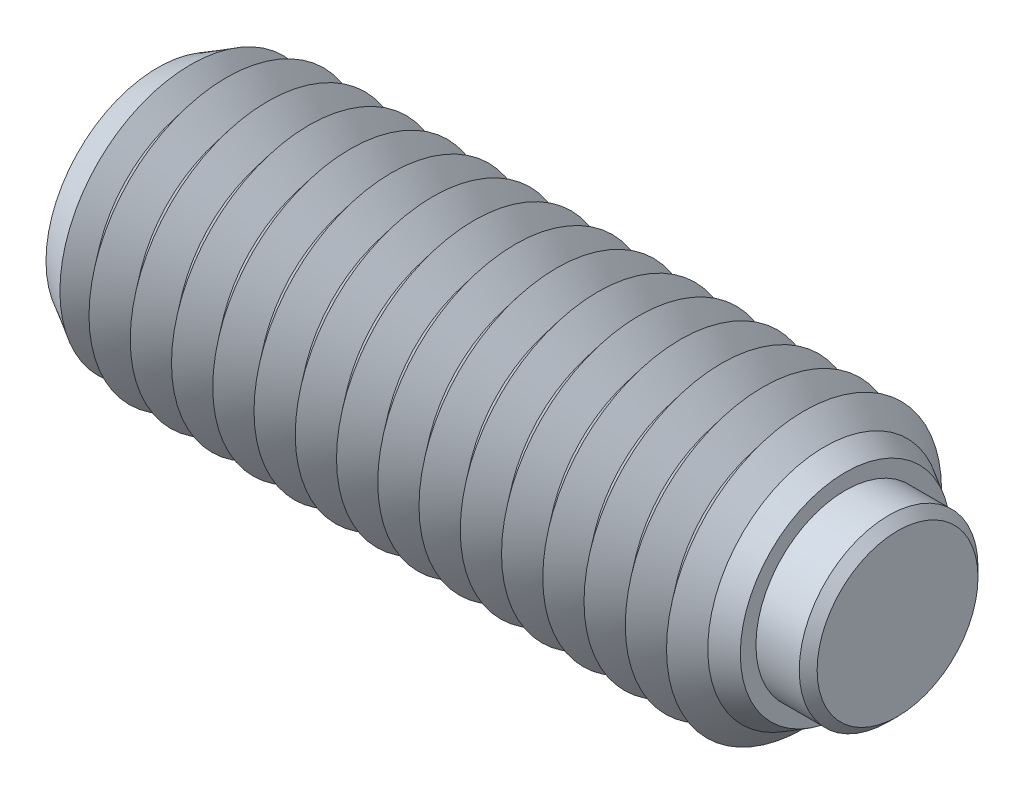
ISO-10303-21;
HEADER;
FILE_DESCRIPTION(('STEP AP214'),'2;1');
FILE_NAME('part.step','',(''),(''),'','','');
FILE_SCHEMA(('AUTOMOTIVE_DESIGN { 1 0 10303 214 1 1 1 1 }'));
ENDSEC;
DATA;
#1=APPLICATION_CONTEXT('core data for automotive mechanical design processes');
#2=APPLICATION_PROTOCOL_DEFINITION('international standard','automotive_design',2000,#1);
#3=PRODUCT_CONTEXT('',#1,'mechanical');
#4=PRODUCT('Part','Part','',(#3));
#5=PRODUCT_RELATED_PRODUCT_CATEGORY('part','',(#4));
#6=PRODUCT_DEFINITION_FORMATION('','',#4);
#7=PRODUCT_DEFINITION_CONTEXT('part definition',#1,'design');
#8=PRODUCT_DEFINITION('design','',#6,#7);
#9=PRODUCT_DEFINITION_SHAPE('','',#8);
#10=(LENGTH_UNIT() NAMED_UNIT(*) SI_UNIT(.MILLI.,.METRE.));
#11=(NAMED_UNIT(*) PLANE_ANGLE_UNIT() SI_UNIT($,.RADIAN.));
#12=(NAMED_UNIT(*) SI_UNIT($,.STERADIAN.) SOLID_ANGLE_UNIT());
#13=UNCERTAINTY_MEASURE_WITH_UNIT(LENGTH_MEASURE(1.E-05),#10,'distance_accuracy_value','');
#14=(GEOMETRIC_REPRESENTATION_CONTEXT(3) GLOBAL_UNCERTAINTY_ASSIGNED_CONTEXT((#13)) GLOBAL_UNIT_ASSIGNED_CONTEXT((#10,
#11,#12)) REPRESENTATION_CONTEXT('',''));
#15=CARTESIAN_POINT('',(0.,0.,0.));
#16=DIRECTION('',(0.,0.,1.));
#17=DIRECTION('',(1.,0.,0.));
#18=AXIS2_PLACEMENT_3D('',#15,#16,#17);
#19=CARTESIAN_POINT('',(2.65,0.,0.));
#20=DIRECTION('',(-1.,0.,0.));
#21=DIRECTION('',(0.,0.,1.));
#22=AXIS2_PLACEMENT_3D('',#19,#20,#21);
#23=CYLINDRICAL_SURFACE('',#22,3.25);
#24=CARTESIAN_POINT('',(2.325,0.,0.));
#25=DIRECTION('',(1.,0.,0.));
#26=DIRECTION('',(0.,0.,-1.));
#27=AXIS2_PLACEMENT_3D('',#24,#25,#26);
#28=CIRCLE('',#27,3.25);
#29=CARTESIAN_POINT('',(2.325,0.,3.25));
#30=VERTEX_POINT('',#29);
#31=EDGE_CURVE('P0_E10',#30,#30,#28,.F.);
#32=CARTESIAN_POINT('',(-1.15,0.,0.));
#33=DIRECTION('',(1.,0.,0.));
#34=DIRECTION('',(0.,0.,-1.));
#35=AXIS2_PLACEMENT_3D('',#32,#33,#34);
#36=CIRCLE('',#35,3.25);
#37=CARTESIAN_POINT('',(-1.15,0.,3.25));
#38=VERTEX_POINT('',#37);
#39=EDGE_CURVE('P0_E25',#38,#38,#36,.T.);
#40=CARTESIAN_POINT('',(2.325,0.,3.25));
#41=CARTESIAN_POINT('',(2.28880208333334,0.,3.25));
#42=CARTESIAN_POINT('',(2.25260416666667,0.,3.25));
#43=CARTESIAN_POINT('',(2.18020833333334,0.,3.25));
#44=CARTESIAN_POINT('',(2.14401041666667,0.,3.25));
#45=CARTESIAN_POINT('',(2.07161458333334,0.,3.25));
#46=CARTESIAN_POINT('',(2.03541666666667,0.,3.25));
#47=CARTESIAN_POINT('',(1.96302083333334,0.,3.25));
#48=CARTESIAN_POINT('',(1.92682291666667,0.,3.25));
#49=CARTESIAN_POINT('',(1.85442708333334,0.,3.25));
#50=CARTESIAN_POINT('',(1.81822916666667,0.,3.25));
#51=CARTESIAN_POINT('',(1.74583333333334,0.,3.25));
#52=CARTESIAN_POINT('',(1.70963541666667,0.,3.25));
#53=CARTESIAN_POINT('',(1.63723958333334,0.,3.25));
#54=CARTESIAN_POINT('',(1.60104166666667,0.,3.25));
#55=CARTESIAN_POINT('',(1.52864583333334,0.,3.25));
#56=CARTESIAN_POINT('',(1.49244791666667,0.,3.25));
#57=CARTESIAN_POINT('',(1.42005208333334,0.,3.25));
#58=CARTESIAN_POINT('',(1.38385416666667,0.,3.25));
#59=CARTESIAN_POINT('',(1.31145833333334,0.,3.25));
#60=CARTESIAN_POINT('',(1.27526041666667,0.,3.25));
#61=CARTESIAN_POINT('',(1.20286458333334,0.,3.25));
#62=CARTESIAN_POINT('',(1.16666666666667,0.,3.25));
#63=CARTESIAN_POINT('',(1.09427083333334,0.,3.25));
#64=CARTESIAN_POINT('',(1.05807291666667,0.,3.25));
#65=CARTESIAN_POINT('',(0.985677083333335,0.,3.25));
#66=CARTESIAN_POINT('',(0.949479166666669,0.,3.25));
#67=CARTESIAN_POINT('',(0.877083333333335,0.,3.25));
#68=CARTESIAN_POINT('',(0.840885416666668,0.,3.25));
#69=CARTESIAN_POINT('',(0.768489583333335,0.,3.25));
#70=CARTESIAN_POINT('',(0.732291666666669,0.,3.25));
#71=CARTESIAN_POINT('',(0.659895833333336,0.,3.25));
#72=CARTESIAN_POINT('',(0.623697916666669,0.,3.25));
#73=CARTESIAN_POINT('',(0.551302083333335,0.,3.25));
#74=CARTESIAN_POINT('',(0.515104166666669,0.,3.25));
#75=CARTESIAN_POINT('',(0.442708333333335,0.,3.25));
#76=CARTESIAN_POINT('',(0.406510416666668,0.,3.25));
#77=CARTESIAN_POINT('',(0.334114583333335,0.,3.25));
#78=CARTESIAN_POINT('',(0.297916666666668,0.,3.25));
#79=CARTESIAN_POINT('',(0.225520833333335,0.,3.25));
#80=CARTESIAN_POINT('',(0.189322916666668,0.,3.25));
#81=CARTESIAN_POINT('',(0.116927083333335,0.,3.25));
#82=CARTESIAN_POINT('',(0.0807291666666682,0.,3.25));
#83=CARTESIAN_POINT('',(0.00833333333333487,0.,3.25));
#84=CARTESIAN_POINT('',(-0.0278645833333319,0.,3.25));
#85=CARTESIAN_POINT('',(-0.100260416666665,0.,3.25));
#86=CARTESIAN_POINT('',(-0.136458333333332,0.,3.25));
#87=CARTESIAN_POINT('',(-0.208854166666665,0.,3.25));
#88=CARTESIAN_POINT('',(-0.245052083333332,0.,3.25));
#89=CARTESIAN_POINT('',(-0.317447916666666,0.,3.25));
#90=CARTESIAN_POINT('',(-0.353645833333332,0.,3.25));
#91=CARTESIAN_POINT('',(-0.426041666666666,0.,3.25));
#92=CARTESIAN_POINT('',(-0.462239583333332,0.,3.25));
#93=CARTESIAN_POINT('',(-0.534635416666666,0.,3.25));
#94=CARTESIAN_POINT('',(-0.570833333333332,0.,3.25));
#95=CARTESIAN_POINT('',(-0.643229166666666,0.,3.25));
#96=CARTESIAN_POINT('',(-0.679427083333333,0.,3.25));
#97=CARTESIAN_POINT('',(-0.751822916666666,0.,3.25));
#98=CARTESIAN_POINT('',(-0.788020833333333,0.,3.25));
#99=CARTESIAN_POINT('',(-0.860416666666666,0.,3.25));
#100=CARTESIAN_POINT('',(-0.896614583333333,0.,3.25));
#101=CARTESIAN_POINT('',(-0.969010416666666,0.,3.25));
#102=CARTESIAN_POINT('',(-1.00520833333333,0.,3.25));
#103=CARTESIAN_POINT('',(-1.07760416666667,0.,3.25));
#104=CARTESIAN_POINT('',(-1.11380208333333,0.,3.25));
#105=CARTESIAN_POINT('',(-1.15,0.,3.25));
#106=B_SPLINE_CURVE_WITH_KNOTS('',3,(#40,#41,#42,#43,#44,#45,#46,#47,#48,#49,#50,#51,#52,#53,
#54,#55,#56,#57,#58,#59,#60,#61,#62,#63,#64,#65,#66,#67,#68,#69,#70,#71,#72,#73,#74,#75,#76,#77,
#78,#79,#80,#81,#82,#83,#84,#85,#86,#87,#88,#89,#90,#91,#92,#93,#94,#95,#96,#97,#98,#99,#100,
#101,#102,#103,#104,#105),.UNSPECIFIED.,.F.,.F.,(4,2,2,2,2,2,2,2,2,2,2,2,2,2,2,2,2,2,2,2,2,2,2,
2,2,2,2,2,2,2,2,2,4),(0.,0.10859375,0.2171875,0.32578125,0.434375,0.54296875,0.6515625,
0.76015625,0.86875,0.977343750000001,1.0859375,1.19453125,1.303125,1.41171875,1.5203125,
1.62890625,1.7375,1.84609375,1.9546875,2.06328125,2.171875,2.28046875,2.3890625,2.49765625,
2.60625,2.71484375,2.8234375,2.93203125,3.040625,3.14921875,3.2578125,3.36640625,3.475),.UNSPECIFIED.);
#107=EDGE_CURVE('P0_BSEAM14',#30,#38,#106,.T.);
#108=ORIENTED_EDGE('',*,*,#31,.T.);
#109=ORIENTED_EDGE('',*,*,#39,.T.);
#110=ORIENTED_EDGE('',*,*,#107,.T.);
#111=ORIENTED_EDGE('',*,*,#107,.F.);
#112=EDGE_LOOP('',(#108,#110,#109,#111));
#113=FACE_BOUND('',#112,.T.);
#114=ADVANCED_FACE('P0_F14',(#113),#23,.T.);
#115=CARTESIAN_POINT('',(2.65,0.,0.));
#116=DIRECTION('',(1.,0.,0.));
#117=DIRECTION('',(0.,0.,-1.));
#118=AXIS2_PLACEMENT_3D('',#115,#116,#117);
#119=PLANE('',#118);
#120=CARTESIAN_POINT('',(2.65,0.,0.));
#121=DIRECTION('',(1.,0.,0.));
#122=DIRECTION('',(0.,0.,-1.));
#123=AXIS2_PLACEMENT_3D('',#120,#121,#122);
#124=CIRCLE('',#123,2.92500000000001);
#125=CARTESIAN_POINT('',(2.65,0.,-2.92500000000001));
#126=VERTEX_POINT('',#125);
#127=EDGE_CURVE('P0_E21',#126,#126,#124,.T.);
#128=ORIENTED_EDGE('',*,*,#127,.T.);
#129=EDGE_LOOP('',(#128));
#130=FACE_BOUND('',#129,.T.);
#131=ADVANCED_FACE('P0_F35',(#130),#119,.T.);
#132=CARTESIAN_POINT('',(-1.15,0.,0.));
#133=DIRECTION('',(1.,0.,0.));
#134=DIRECTION('',(0.,0.,-1.));
#135=AXIS2_PLACEMENT_3D('',#132,#133,#134);
#136=PLANE('',#135);
#137=ORIENTED_EDGE('',*,*,#39,.F.);
#138=EDGE_LOOP('',(#137));
#139=FACE_BOUND('',#138,.T.);
#140=ADVANCED_FACE('P0_F33',(#139),#136,.F.);
#141=CARTESIAN_POINT('',(2.65,0.,0.));
#142=DIRECTION('',(-1.,0.,0.));
#143=DIRECTION('',(0.,0.,1.));
#144=AXIS2_PLACEMENT_3D('',#141,#142,#143);
#145=CONICAL_SURFACE('',#144,2.92500000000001,0.785398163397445);
#146=ORIENTED_EDGE('',*,*,#31,.F.);
#147=EDGE_LOOP('',(#146));
#148=FACE_BOUND('',#147,.T.);
#149=ORIENTED_EDGE('',*,*,#127,.F.);
#150=EDGE_LOOP('',(#149));
#151=FACE_BOUND('',#150,.T.);
#152=ADVANCED_FACE('P0_F16',(#148,#151),#145,.T.);
#153=CLOSED_SHELL('',(#114,#131,#140,#152));
#154=MANIFOLD_SOLID_BREP('P0_B1',#153);
#155=CARTESIAN_POINT('',(-23.25,0.,0.));
#156=DIRECTION('',(-1.,0.,0.));
#157=DIRECTION('',(0.,0.,1.));
#158=AXIS2_PLACEMENT_3D('',#155,#156,#157);
#159=CONICAL_SURFACE('',#158,5.,0.895664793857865);
#160=CARTESIAN_POINT('',(-22.5,0.,0.));
#161=DIRECTION('',(1.,0.,0.));
#162=DIRECTION('',(0.,0.,-1.));
#163=AXIS2_PLACEMENT_3D('',#160,#161,#162);
#164=CIRCLE('',#163,4.06325030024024);
#165=CARTESIAN_POINT('',(-22.5,0.,-4.06325030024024));
#166=VERTEX_POINT('',#165);
#167=EDGE_CURVE('P1_E879',#166,#166,#164,.T.);
#168=ORIENTED_EDGE('',*,*,#167,.F.);
#169=EDGE_LOOP('',(#168));
#170=FACE_BOUND('',#169,.T.);
#171=CARTESIAN_POINT('',(-23.0532143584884,0.,0.));
#172=DIRECTION('',(1.,0.,0.));
#173=DIRECTION('',(0.,0.,-1.));
#174=AXIS2_PLACEMENT_3D('',#171,#172,#173);
#175=CIRCLE('',#174,4.75421481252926);
#176=CARTESIAN_POINT('',(-23.0532143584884,0.,-4.75421481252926));
#177=VERTEX_POINT('',#176);
#178=EDGE_CURVE('P1_E882',#177,#177,#175,.F.);
#179=ORIENTED_EDGE('',*,*,#178,.F.);
#180=EDGE_LOOP('',(#179));
#181=FACE_BOUND('',#180,.T.);
#182=ADVANCED_FACE('P1_F15',(#170,#181),#159,.T.);
#183=CARTESIAN_POINT('',(-1.50000000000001,0.,0.));
#184=DIRECTION('',(1.,0.,0.));
#185=DIRECTION('',(0.,0.,-1.));
#186=AXIS2_PLACEMENT_3D('',#183,#184,#185);
#187=CONICAL_SURFACE('',#186,4.06325030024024,0.895664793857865);
#188=CARTESIAN_POINT('',(-0.750000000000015,0.,0.));
#189=DIRECTION('',(1.,0.,0.));
#190=DIRECTION('',(0.,0.,-1.));
#191=AXIS2_PLACEMENT_3D('',#188,#189,#190);
#192=CIRCLE('',#191,5.);
#193=CARTESIAN_POINT('',(-0.750000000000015,0.,-5.));
#194=VERTEX_POINT('',#193);
#195=EDGE_CURVE('P1_E791',#194,#194,#192,.T.);
#196=ORIENTED_EDGE('',*,*,#195,.F.);
#197=EDGE_LOOP('',(#196));
#198=FACE_BOUND('',#197,.T.);
#199=CARTESIAN_POINT('',(-1.50000000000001,0.,0.));
#200=DIRECTION('',(1.,0.,0.));
#201=DIRECTION('',(0.,0.,-1.));
#202=AXIS2_PLACEMENT_3D('',#199,#200,#201);
#203=CIRCLE('',#202,4.06325030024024);
#204=CARTESIAN_POINT('',(-1.50000000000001,0.,-4.06325030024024));
#205=VERTEX_POINT('',#204);
#206=EDGE_CURVE('P1_E792',#205,#205,#203,.T.);
#207=ORIENTED_EDGE('',*,*,#206,.T.);
#208=EDGE_LOOP('',(#207));
#209=FACE_BOUND('',#208,.T.);
#210=ADVANCED_FACE('P1_F222',(#198,#209),#187,.T.);
#211=CARTESIAN_POINT('',(-2.25000000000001,0.,0.));
#212=DIRECTION('',(-1.,0.,0.));
#213=DIRECTION('',(0.,0.,1.));
#214=AXIS2_PLACEMENT_3D('',#211,#212,#213);
#215=CONICAL_SURFACE('',#214,5.,0.895664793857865);
#216=ORIENTED_EDGE('',*,*,#206,.F.);
#217=EDGE_LOOP('',(#216));
#218=FACE_BOUND('',#217,.T.);
#219=CARTESIAN_POINT('',(-2.25000000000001,0.,0.));
#220=DIRECTION('',(1.,0.,0.));
#221=DIRECTION('',(0.,0.,-1.));
#222=AXIS2_PLACEMENT_3D('',#219,#220,#221);
#223=CIRCLE('',#222,5.);
#224=CARTESIAN_POINT('',(-2.25000000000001,0.,-5.));
#225=VERTEX_POINT('',#224);
#226=EDGE_CURVE('P1_E796',#225,#225,#223,.T.);
#227=ORIENTED_EDGE('',*,*,#226,.T.);
#228=EDGE_LOOP('',(#227));
#229=FACE_BOUND('',#228,.T.);
#230=ADVANCED_FACE('P1_F227',(#218,#229),#215,.T.);
#231=CARTESIAN_POINT('',(-1.15,0.,0.));
#232=DIRECTION('',(1.,0.,0.));
#233=DIRECTION('',(0.,1.,0.));
#234=AXIS2_PLACEMENT_3D('',#231,#232,#233);
#235=PLANE('',#234);
#236=CARTESIAN_POINT('',(-1.15,0.,0.));
#237=DIRECTION('',(1.,0.,0.));
#238=DIRECTION('',(0.,1.,0.));
#239=AXIS2_PLACEMENT_3D('',#236,#237,#238);
#240=CIRCLE('',#239,3.25);
#241=CARTESIAN_POINT('',(-1.15,3.25,0.));
#242=VERTEX_POINT('',#241);
#243=EDGE_CURVE('P1_E414',#242,#242,#240,.T.);
#244=ORIENTED_EDGE('',*,*,#243,.T.);
#245=EDGE_LOOP('',(#244));
#246=FACE_BOUND('',#245,.T.);
#247=ADVANCED_FACE('P1_F341',(#246),#235,.T.);
#248=CARTESIAN_POINT('',(-1.15,0.,0.));
#249=DIRECTION('',(1.,0.,0.));
#250=DIRECTION('',(0.,1.,0.));
#251=AXIS2_PLACEMENT_3D('',#248,#249,#250);
#252=CYLINDRICAL_SURFACE('',#251,3.25);
#253=CARTESIAN_POINT('',(0.75,0.,0.));
#254=DIRECTION('',(1.,0.,0.));
#255=DIRECTION('',(0.,1.,0.));
#256=AXIS2_PLACEMENT_3D('',#253,#254,#255);
#257=CIRCLE('',#256,3.25);
#258=CARTESIAN_POINT('',(0.75,3.25,0.));
#259=VERTEX_POINT('',#258);
#260=EDGE_CURVE('P1_E417',#259,#259,#257,.T.);
#261=CARTESIAN_POINT('',(-1.15,3.25,0.));
#262=CARTESIAN_POINT('',(-1.13020833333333,3.25,0.));
#263=CARTESIAN_POINT('',(-1.11041666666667,3.25,0.));
#264=CARTESIAN_POINT('',(-1.07083333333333,3.25,0.));
#265=CARTESIAN_POINT('',(-1.05104166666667,3.25,0.));
#266=CARTESIAN_POINT('',(-1.01145833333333,3.25,0.));
#267=CARTESIAN_POINT('',(-0.991666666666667,3.25,0.));
#268=CARTESIAN_POINT('',(-0.952083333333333,3.25,0.));
#269=CARTESIAN_POINT('',(-0.932291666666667,3.25,0.));
#270=CARTESIAN_POINT('',(-0.892708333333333,3.25,0.));
#271=CARTESIAN_POINT('',(-0.872916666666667,3.25,0.));
#272=CARTESIAN_POINT('',(-0.833333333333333,3.25,0.));
#273=CARTESIAN_POINT('',(-0.813541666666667,3.25,0.));
#274=CARTESIAN_POINT('',(-0.773958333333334,3.25,0.));
#275=CARTESIAN_POINT('',(-0.754166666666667,3.25,0.));
#276=CARTESIAN_POINT('',(-0.714583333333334,3.25,0.));
#277=CARTESIAN_POINT('',(-0.694791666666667,3.25,0.));
#278=CARTESIAN_POINT('',(-0.655208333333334,3.25,0.));
#279=CARTESIAN_POINT('',(-0.635416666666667,3.25,0.));
#280=CARTESIAN_POINT('',(-0.595833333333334,3.25,0.));
#281=CARTESIAN_POINT('',(-0.576041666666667,3.25,0.));
#282=CARTESIAN_POINT('',(-0.536458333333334,3.25,0.));
#283=CARTESIAN_POINT('',(-0.516666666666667,3.25,0.));
#284=CARTESIAN_POINT('',(-0.477083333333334,3.25,0.));
#285=CARTESIAN_POINT('',(-0.457291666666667,3.25,0.));
#286=CARTESIAN_POINT('',(-0.417708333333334,3.25,0.));
#287=CARTESIAN_POINT('',(-0.397916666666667,3.25,0.));
#288=CARTESIAN_POINT('',(-0.358333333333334,3.25,0.));
#289=CARTESIAN_POINT('',(-0.338541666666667,3.25,0.));
#290=CARTESIAN_POINT('',(-0.298958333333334,3.25,0.));
#291=CARTESIAN_POINT('',(-0.279166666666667,3.25,0.));
#292=CARTESIAN_POINT('',(-0.239583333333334,3.25,0.));
#293=CARTESIAN_POINT('',(-0.219791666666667,3.25,0.));
#294=CARTESIAN_POINT('',(-0.180208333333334,3.25,0.));
#295=CARTESIAN_POINT('',(-0.160416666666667,3.25,0.));
#296=CARTESIAN_POINT('',(-0.120833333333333,3.25,0.));
#297=CARTESIAN_POINT('',(-0.101041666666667,3.25,0.));
#298=CARTESIAN_POINT('',(-0.0614583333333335,3.25,0.));
#299=CARTESIAN_POINT('',(-0.0416666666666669,3.25,0.));
#300=CARTESIAN_POINT('',(-0.00208333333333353,3.25,0.));
#301=CARTESIAN_POINT('',(0.0177083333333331,3.25,0.));
#302=CARTESIAN_POINT('',(0.0572916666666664,3.25,0.));
#303=CARTESIAN_POINT('',(0.0770833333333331,3.25,0.));
#304=CARTESIAN_POINT('',(0.116666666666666,3.25,0.));
#305=CARTESIAN_POINT('',(0.136458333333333,3.25,0.));
#306=CARTESIAN_POINT('',(0.176041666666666,3.25,0.));
#307=CARTESIAN_POINT('',(0.195833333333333,3.25,0.));
#308=CARTESIAN_POINT('',(0.235416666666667,3.25,0.));
#309=CARTESIAN_POINT('',(0.255208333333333,3.25,0.));
#310=CARTESIAN_POINT('',(0.294791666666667,3.25,0.));
#311=CARTESIAN_POINT('',(0.314583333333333,3.25,0.));
#312=CARTESIAN_POINT('',(0.354166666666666,3.25,0.));
#313=CARTESIAN_POINT('',(0.373958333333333,3.25,0.));
#314=CARTESIAN_POINT('',(0.413541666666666,3.25,0.));
#315=CARTESIAN_POINT('',(0.433333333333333,3.25,0.));
#316=CARTESIAN_POINT('',(0.472916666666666,3.25,0.));
#317=CARTESIAN_POINT('',(0.492708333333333,3.25,0.));
#318=CARTESIAN_POINT('',(0.532291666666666,3.25,0.));
#319=CARTESIAN_POINT('',(0.552083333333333,3.25,0.));
#320=CARTESIAN_POINT('',(0.591666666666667,3.25,0.));
#321=CARTESIAN_POINT('',(0.611458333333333,3.25,0.));
#322=CARTESIAN_POINT('',(0.651041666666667,3.25,0.));
#323=CARTESIAN_POINT('',(0.670833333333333,3.25,0.));
#324=CARTESIAN_POINT('',(0.710416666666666,3.25,0.));
#325=CARTESIAN_POINT('',(0.730208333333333,3.25,0.));
#326=CARTESIAN_POINT('',(0.75,3.25,0.));
#327=B_SPLINE_CURVE_WITH_KNOTS('',3,(#261,#262,#263,#264,#265,#266,#267,#268,#269,#270,#271,
#272,#273,#274,#275,#276,#277,#278,#279,#280,#281,#282,#283,#284,#285,#286,#287,#288,#289,#290,
#291,#292,#293,#294,#295,#296,#297,#298,#299,#300,#301,#302,#303,#304,#305,#306,#307,#308,#309,
#310,#311,#312,#313,#314,#315,#316,#317,#318,#319,#320,#321,#322,#323,#324,#325,#326),
.UNSPECIFIED.,.F.,.F.,(4,2,2,2,2,2,2,2,2,2,2,2,2,2,2,2,2,2,2,2,2,2,2,2,2,2,2,2,2,2,2,2,4),(0.,
0.059375,0.11875,0.178125,0.2375,0.296875,0.35625,0.415625,0.475,0.534375,0.59375,0.653125,
0.7125,0.771875,0.83125,0.890625,0.95,1.009375,1.06875,1.128125,1.1875,1.246875,1.30625,
1.365625,1.425,1.484375,1.54375,1.603125,1.6625,1.721875,1.78125,1.840625,1.9),.UNSPECIFIED.);
#328=EDGE_CURVE('P1_BSEAM209',#242,#259,#327,.T.);
#329=ORIENTED_EDGE('',*,*,#243,.F.);
#330=ORIENTED_EDGE('',*,*,#260,.T.);
#331=ORIENTED_EDGE('',*,*,#328,.T.);
#332=ORIENTED_EDGE('',*,*,#328,.F.);
#333=EDGE_LOOP('',(#329,#331,#330,#332));
#334=FACE_BOUND('',#333,.T.);
#335=ADVANCED_FACE('P1_F209',(#334),#252,.F.);
#336=CARTESIAN_POINT('',(0.75,3.81698729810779,0.));
#337=DIRECTION('',(1.,0.,0.));
#338=DIRECTION('',(0.,1.,0.));
#339=AXIS2_PLACEMENT_3D('',#336,#337,#338);
#340=PLANE('',#339);
#341=ORIENTED_EDGE('',*,*,#260,.F.);
#342=EDGE_LOOP('',(#341));
#343=FACE_BOUND('',#342,.T.);
#344=CARTESIAN_POINT('',(0.75,0.,0.));
#345=DIRECTION('',(1.,0.,0.));
#346=DIRECTION('',(0.,1.,0.));
#347=AXIS2_PLACEMENT_3D('',#344,#345,#346);
#348=CIRCLE('',#347,3.81698729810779);
#349=CARTESIAN_POINT('',(0.75,3.81698729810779,0.));
#350=VERTEX_POINT('',#349);
#351=EDGE_CURVE('P1_E121',#350,#350,#348,.T.);
#352=ORIENTED_EDGE('',*,*,#351,.T.);
#353=EDGE_LOOP('',(#352));
#354=FACE_BOUND('',#353,.T.);
#355=ADVANCED_FACE('P1_F206',(#343,#354),#340,.T.);
#356=CARTESIAN_POINT('',(0.75,0.,0.));
#357=DIRECTION('',(-1.,0.,0.));
#358=DIRECTION('',(0.,-1.,0.));
#359=AXIS2_PLACEMENT_3D('',#356,#357,#358);
#360=CONICAL_SURFACE('',#359,3.81698729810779,0.523598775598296);
#361=CARTESIAN_POINT('',(0.,0.,0.));
#362=DIRECTION('',(1.,0.,0.));
#363=DIRECTION('',(0.,0.,-1.));
#364=AXIS2_PLACEMENT_3D('',#361,#362,#363);
#365=CIRCLE('',#364,4.25);
#366=CARTESIAN_POINT('',(0.,0.,-4.25));
#367=VERTEX_POINT('',#366);
#368=EDGE_CURVE('P1_E405',#367,#367,#365,.T.);
#369=ORIENTED_EDGE('',*,*,#368,.T.);
#370=EDGE_LOOP('',(#369));
#371=FACE_BOUND('',#370,.T.);
#372=ORIENTED_EDGE('',*,*,#351,.F.);
#373=EDGE_LOOP('',(#372));
#374=FACE_BOUND('',#373,.T.);
#375=ADVANCED_FACE('P1_F203',(#371,#374),#360,.T.);
#376=CARTESIAN_POINT('',(0.,0.,0.));
#377=DIRECTION('',(-1.,0.,0.));
#378=DIRECTION('',(0.,0.,1.));
#379=AXIS2_PLACEMENT_3D('',#376,#377,#378);
#380=CONICAL_SURFACE('',#379,4.25,0.785398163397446);
#381=ORIENTED_EDGE('',*,*,#195,.T.);
#382=EDGE_LOOP('',(#381));
#383=FACE_BOUND('',#382,.T.);
#384=ORIENTED_EDGE('',*,*,#368,.F.);
#385=EDGE_LOOP('',(#384));
#386=FACE_BOUND('',#385,.T.);
#387=ADVANCED_FACE('P1_F17',(#383,#386),#380,.T.);
#388=CARTESIAN_POINT('',(-3.00000000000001,0.,0.));
#389=DIRECTION('',(1.,0.,0.));
#390=DIRECTION('',(0.,0.,-1.));
#391=AXIS2_PLACEMENT_3D('',#388,#389,#390);
#392=CONICAL_SURFACE('',#391,4.06325030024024,0.895664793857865);
#393=ORIENTED_EDGE('',*,*,#226,.F.);
#394=EDGE_LOOP('',(#393));
#395=FACE_BOUND('',#394,.T.);
#396=CARTESIAN_POINT('',(-3.00000000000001,0.,0.));
#397=DIRECTION('',(1.,0.,0.));
#398=DIRECTION('',(0.,0.,-1.));
#399=AXIS2_PLACEMENT_3D('',#396,#397,#398);
#400=CIRCLE('',#399,4.06325030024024);
#401=CARTESIAN_POINT('',(-3.00000000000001,0.,-4.06325030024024));
#402=VERTEX_POINT('',#401);
#403=EDGE_CURVE('P1_E801',#402,#402,#400,.T.);
#404=ORIENTED_EDGE('',*,*,#403,.T.);
#405=EDGE_LOOP('',(#404));
#406=FACE_BOUND('',#405,.T.);
#407=ADVANCED_FACE('P1_F335',(#395,#406),#392,.T.);
#408=CARTESIAN_POINT('',(-3.75000000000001,0.,0.));
#409=DIRECTION('',(-1.,0.,0.));
#410=DIRECTION('',(0.,0.,1.));
#411=AXIS2_PLACEMENT_3D('',#408,#409,#410);
#412=CONICAL_SURFACE('',#411,5.,0.895664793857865);
#413=ORIENTED_EDGE('',*,*,#403,.F.);
#414=EDGE_LOOP('',(#413));
#415=FACE_BOUND('',#414,.T.);
#416=CARTESIAN_POINT('',(-3.75000000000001,0.,0.));
#417=DIRECTION('',(1.,0.,0.));
#418=DIRECTION('',(0.,0.,-1.));
#419=AXIS2_PLACEMENT_3D('',#416,#417,#418);
#420=CIRCLE('',#419,5.);
#421=CARTESIAN_POINT('',(-3.75000000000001,0.,-5.));
#422=VERTEX_POINT('',#421);
#423=EDGE_CURVE('P1_E804',#422,#422,#420,.T.);
#424=ORIENTED_EDGE('',*,*,#423,.T.);
#425=EDGE_LOOP('',(#424));
#426=FACE_BOUND('',#425,.T.);
#427=ADVANCED_FACE('P1_F331',(#415,#426),#412,.T.);
#428=CARTESIAN_POINT('',(-4.50000000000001,0.,0.));
#429=DIRECTION('',(1.,0.,0.));
#430=DIRECTION('',(0.,0.,-1.));
#431=AXIS2_PLACEMENT_3D('',#428,#429,#430);
#432=CONICAL_SURFACE('',#431,4.06325030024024,0.895664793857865);
#433=ORIENTED_EDGE('',*,*,#423,.F.);
#434=EDGE_LOOP('',(#433));
#435=FACE_BOUND('',#434,.T.);
#436=CARTESIAN_POINT('',(-4.50000000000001,0.,0.));
#437=DIRECTION('',(1.,0.,0.));
#438=DIRECTION('',(0.,0.,-1.));
#439=AXIS2_PLACEMENT_3D('',#436,#437,#438);
#440=CIRCLE('',#439,4.06325030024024);
#441=CARTESIAN_POINT('',(-4.50000000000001,0.,-4.06325030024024));
#442=VERTEX_POINT('',#441);
#443=EDGE_CURVE('P1_E807',#442,#442,#440,.T.);
#444=ORIENTED_EDGE('',*,*,#443,.T.);
#445=EDGE_LOOP('',(#444));
#446=FACE_BOUND('',#445,.T.);
#447=ADVANCED_FACE('P1_F327',(#435,#446),#432,.T.);
#448=CARTESIAN_POINT('',(-5.25000000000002,0.,0.));
#449=DIRECTION('',(-1.,0.,0.));
#450=DIRECTION('',(0.,0.,1.));
#451=AXIS2_PLACEMENT_3D('',#448,#449,#450);
#452=CONICAL_SURFACE('',#451,5.,0.895664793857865);
#453=ORIENTED_EDGE('',*,*,#443,.F.);
#454=EDGE_LOOP('',(#453));
#455=FACE_BOUND('',#454,.T.);
#456=CARTESIAN_POINT('',(-5.25000000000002,0.,0.));
#457=DIRECTION('',(1.,0.,0.));
#458=DIRECTION('',(0.,0.,-1.));
#459=AXIS2_PLACEMENT_3D('',#456,#457,#458);
#460=CIRCLE('',#459,5.);
#461=CARTESIAN_POINT('',(-5.25000000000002,0.,-5.));
#462=VERTEX_POINT('',#461);
#463=EDGE_CURVE('P1_E810',#462,#462,#460,.T.);
#464=ORIENTED_EDGE('',*,*,#463,.T.);
#465=EDGE_LOOP('',(#464));
#466=FACE_BOUND('',#465,.T.);
#467=ADVANCED_FACE('P1_F323',(#455,#466),#452,.T.);
#468=CARTESIAN_POINT('',(-6.00000000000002,0.,0.));
#469=DIRECTION('',(1.,0.,0.));
#470=DIRECTION('',(0.,0.,-1.));
#471=AXIS2_PLACEMENT_3D('',#468,#469,#470);
#472=CONICAL_SURFACE('',#471,4.06325030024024,0.895664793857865);
#473=ORIENTED_EDGE('',*,*,#463,.F.);
#474=EDGE_LOOP('',(#473));
#475=FACE_BOUND('',#474,.T.);
#476=CARTESIAN_POINT('',(-6.00000000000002,0.,0.));
#477=DIRECTION('',(1.,0.,0.));
#478=DIRECTION('',(0.,0.,-1.));
#479=AXIS2_PLACEMENT_3D('',#476,#477,#478);
#480=CIRCLE('',#479,4.06325030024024);
#481=CARTESIAN_POINT('',(-6.00000000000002,0.,-4.06325030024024));
#482=VERTEX_POINT('',#481);
#483=EDGE_CURVE('P1_E813',#482,#482,#480,.T.);
#484=ORIENTED_EDGE('',*,*,#483,.T.);
#485=EDGE_LOOP('',(#484));
#486=FACE_BOUND('',#485,.T.);
#487=ADVANCED_FACE('P1_F319',(#475,#486),#472,.T.);
#488=CARTESIAN_POINT('',(-6.75000000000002,0.,0.));
#489=DIRECTION('',(-1.,0.,0.));
#490=DIRECTION('',(0.,0.,1.));
#491=AXIS2_PLACEMENT_3D('',#488,#489,#490);
#492=CONICAL_SURFACE('',#491,5.,0.895664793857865);
#493=ORIENTED_EDGE('',*,*,#483,.F.);
#494=EDGE_LOOP('',(#493));
#495=FACE_BOUND('',#494,.T.);
#496=CARTESIAN_POINT('',(-6.75000000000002,0.,0.));
#497=DIRECTION('',(1.,0.,0.));
#498=DIRECTION('',(0.,0.,-1.));
#499=AXIS2_PLACEMENT_3D('',#496,#497,#498);
#500=CIRCLE('',#499,5.);
#501=CARTESIAN_POINT('',(-6.75000000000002,0.,-5.));
#502=VERTEX_POINT('',#501);
#503=EDGE_CURVE('P1_E816',#502,#502,#500,.T.);
#504=ORIENTED_EDGE('',*,*,#503,.T.);
#505=EDGE_LOOP('',(#504));
#506=FACE_BOUND('',#505,.T.);
#507=ADVANCED_FACE('P1_F315',(#495,#506),#492,.T.);
#508=CARTESIAN_POINT('',(-7.50000000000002,0.,0.));
#509=DIRECTION('',(1.,0.,0.));
#510=DIRECTION('',(0.,0.,-1.));
#511=AXIS2_PLACEMENT_3D('',#508,#509,#510);
#512=CONICAL_SURFACE('',#511,4.06325030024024,0.895664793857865);
#513=ORIENTED_EDGE('',*,*,#503,.F.);
#514=EDGE_LOOP('',(#513));
#515=FACE_BOUND('',#514,.T.);
#516=CARTESIAN_POINT('',(-7.50000000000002,0.,0.));
#517=DIRECTION('',(1.,0.,0.));
#518=DIRECTION('',(0.,0.,-1.));
#519=AXIS2_PLACEMENT_3D('',#516,#517,#518);
#520=CIRCLE('',#519,4.06325030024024);
#521=CARTESIAN_POINT('',(-7.50000000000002,0.,-4.06325030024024));
#522=VERTEX_POINT('',#521);
#523=EDGE_CURVE('P1_E819',#522,#522,#520,.T.);
#524=ORIENTED_EDGE('',*,*,#523,.T.);
#525=EDGE_LOOP('',(#524));
#526=FACE_BOUND('',#525,.T.);
#527=ADVANCED_FACE('P1_F311',(#515,#526),#512,.T.);
#528=CARTESIAN_POINT('',(-8.25000000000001,0.,0.));
#529=DIRECTION('',(-1.,0.,0.));
#530=DIRECTION('',(0.,0.,1.));
#531=AXIS2_PLACEMENT_3D('',#528,#529,#530);
#532=CONICAL_SURFACE('',#531,5.,0.895664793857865);
#533=ORIENTED_EDGE('',*,*,#523,.F.);
#534=EDGE_LOOP('',(#533));
#535=FACE_BOUND('',#534,.T.);
#536=CARTESIAN_POINT('',(-8.25000000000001,0.,0.));
#537=DIRECTION('',(1.,0.,0.));
#538=DIRECTION('',(0.,0.,-1.));
#539=AXIS2_PLACEMENT_3D('',#536,#537,#538);
#540=CIRCLE('',#539,5.);
#541=CARTESIAN_POINT('',(-8.25000000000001,0.,-5.));
#542=VERTEX_POINT('',#541);
#543=EDGE_CURVE('P1_E822',#542,#542,#540,.T.);
#544=ORIENTED_EDGE('',*,*,#543,.T.);
#545=EDGE_LOOP('',(#544));
#546=FACE_BOUND('',#545,.T.);
#547=ADVANCED_FACE('P1_F307',(#535,#546),#532,.T.);
#548=CARTESIAN_POINT('',(-9.00000000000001,0.,0.));
#549=DIRECTION('',(1.,0.,0.));
#550=DIRECTION('',(0.,0.,-1.));
#551=AXIS2_PLACEMENT_3D('',#548,#549,#550);
#552=CONICAL_SURFACE('',#551,4.06325030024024,0.895664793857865);
#553=ORIENTED_EDGE('',*,*,#543,.F.);
#554=EDGE_LOOP('',(#553));
#555=FACE_BOUND('',#554,.T.);
#556=CARTESIAN_POINT('',(-9.00000000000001,0.,0.));
#557=DIRECTION('',(1.,0.,0.));
#558=DIRECTION('',(0.,0.,-1.));
#559=AXIS2_PLACEMENT_3D('',#556,#557,#558);
#560=CIRCLE('',#559,4.06325030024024);
#561=CARTESIAN_POINT('',(-9.00000000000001,0.,-4.06325030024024));
#562=VERTEX_POINT('',#561);
#563=EDGE_CURVE('P1_E825',#562,#562,#560,.T.);
#564=ORIENTED_EDGE('',*,*,#563,.T.);
#565=EDGE_LOOP('',(#564));
#566=FACE_BOUND('',#565,.T.);
#567=ADVANCED_FACE('P1_F303',(#555,#566),#552,.T.);
#568=CARTESIAN_POINT('',(-9.75000000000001,0.,0.));
#569=DIRECTION('',(-1.,0.,0.));
#570=DIRECTION('',(0.,0.,1.));
#571=AXIS2_PLACEMENT_3D('',#568,#569,#570);
#572=CONICAL_SURFACE('',#571,5.,0.895664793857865);
#573=ORIENTED_EDGE('',*,*,#563,.F.);
#574=EDGE_LOOP('',(#573));
#575=FACE_BOUND('',#574,.T.);
#576=CARTESIAN_POINT('',(-9.75000000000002,0.,0.));
#577=DIRECTION('',(1.,0.,0.));
#578=DIRECTION('',(0.,0.,-1.));
#579=AXIS2_PLACEMENT_3D('',#576,#577,#578);
#580=CIRCLE('',#579,5.);
#581=CARTESIAN_POINT('',(-9.75000000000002,0.,-5.));
#582=VERTEX_POINT('',#581);
#583=EDGE_CURVE('P1_E828',#582,#582,#580,.T.);
#584=ORIENTED_EDGE('',*,*,#583,.T.);
#585=EDGE_LOOP('',(#584));
#586=FACE_BOUND('',#585,.T.);
#587=ADVANCED_FACE('P1_F299',(#575,#586),#572,.T.);
#588=CARTESIAN_POINT('',(-10.5,0.,0.));
#589=DIRECTION('',(1.,0.,0.));
#590=DIRECTION('',(0.,0.,-1.));
#591=AXIS2_PLACEMENT_3D('',#588,#589,#590);
#592=CONICAL_SURFACE('',#591,4.06325030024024,0.895664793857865);
#593=ORIENTED_EDGE('',*,*,#583,.F.);
#594=EDGE_LOOP('',(#593));
#595=FACE_BOUND('',#594,.T.);
#596=CARTESIAN_POINT('',(-10.5,0.,0.));
#597=DIRECTION('',(1.,0.,0.));
#598=DIRECTION('',(0.,0.,-1.));
#599=AXIS2_PLACEMENT_3D('',#596,#597,#598);
#600=CIRCLE('',#599,4.06325030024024);
#601=CARTESIAN_POINT('',(-10.5,0.,-4.06325030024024));
#602=VERTEX_POINT('',#601);
#603=EDGE_CURVE('P1_E831',#602,#602,#600,.T.);
#604=ORIENTED_EDGE('',*,*,#603,.T.);
#605=EDGE_LOOP('',(#604));
#606=FACE_BOUND('',#605,.T.);
#607=ADVANCED_FACE('P1_F295',(#595,#606),#592,.T.);
#608=CARTESIAN_POINT('',(-11.25,0.,0.));
#609=DIRECTION('',(-1.,0.,0.));
#610=DIRECTION('',(0.,0.,1.));
#611=AXIS2_PLACEMENT_3D('',#608,#609,#610);
#612=CONICAL_SURFACE('',#611,5.,0.895664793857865);
#613=ORIENTED_EDGE('',*,*,#603,.F.);
#614=EDGE_LOOP('',(#613));
#615=FACE_BOUND('',#614,.T.);
#616=CARTESIAN_POINT('',(-11.25,0.,0.));
#617=DIRECTION('',(1.,0.,0.));
#618=DIRECTION('',(0.,0.,-1.));
#619=AXIS2_PLACEMENT_3D('',#616,#617,#618);
#620=CIRCLE('',#619,5.);
#621=CARTESIAN_POINT('',(-11.25,0.,-5.));
#622=VERTEX_POINT('',#621);
#623=EDGE_CURVE('P1_E834',#622,#622,#620,.T.);
#624=ORIENTED_EDGE('',*,*,#623,.T.);
#625=EDGE_LOOP('',(#624));
#626=FACE_BOUND('',#625,.T.);
#627=ADVANCED_FACE('P1_F291',(#615,#626),#612,.T.);
#628=CARTESIAN_POINT('',(-12.,0.,0.));
#629=DIRECTION('',(1.,0.,0.));
#630=DIRECTION('',(0.,0.,-1.));
#631=AXIS2_PLACEMENT_3D('',#628,#629,#630);
#632=CONICAL_SURFACE('',#631,4.06325030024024,0.895664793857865);
#633=ORIENTED_EDGE('',*,*,#623,.F.);
#634=EDGE_LOOP('',(#633));
#635=FACE_BOUND('',#634,.T.);
#636=CARTESIAN_POINT('',(-12.,0.,0.));
#637=DIRECTION('',(1.,0.,0.));
#638=DIRECTION('',(0.,0.,-1.));
#639=AXIS2_PLACEMENT_3D('',#636,#637,#638);
#640=CIRCLE('',#639,4.06325030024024);
#641=CARTESIAN_POINT('',(-12.,0.,-4.06325030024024));
#642=VERTEX_POINT('',#641);
#643=EDGE_CURVE('P1_E837',#642,#642,#640,.T.);
#644=ORIENTED_EDGE('',*,*,#643,.T.);
#645=EDGE_LOOP('',(#644));
#646=FACE_BOUND('',#645,.T.);
#647=ADVANCED_FACE('P1_F287',(#635,#646),#632,.T.);
#648=CARTESIAN_POINT('',(-12.75,0.,0.));
#649=DIRECTION('',(-1.,0.,0.));
#650=DIRECTION('',(0.,0.,1.));
#651=AXIS2_PLACEMENT_3D('',#648,#649,#650);
#652=CONICAL_SURFACE('',#651,5.,0.895664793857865);
#653=ORIENTED_EDGE('',*,*,#643,.F.);
#654=EDGE_LOOP('',(#653));
#655=FACE_BOUND('',#654,.T.);
#656=CARTESIAN_POINT('',(-12.75,0.,0.));
#657=DIRECTION('',(1.,0.,0.));
#658=DIRECTION('',(0.,0.,-1.));
#659=AXIS2_PLACEMENT_3D('',#656,#657,#658);
#660=CIRCLE('',#659,5.);
#661=CARTESIAN_POINT('',(-12.75,0.,-5.));
#662=VERTEX_POINT('',#661);
#663=EDGE_CURVE('P1_E840',#662,#662,#660,.T.);
#664=ORIENTED_EDGE('',*,*,#663,.T.);
#665=EDGE_LOOP('',(#664));
#666=FACE_BOUND('',#665,.T.);
#667=ADVANCED_FACE('P1_F283',(#655,#666),#652,.T.);
#668=CARTESIAN_POINT('',(-13.5,0.,0.));
#669=DIRECTION('',(1.,0.,0.));
#670=DIRECTION('',(0.,0.,-1.));
#671=AXIS2_PLACEMENT_3D('',#668,#669,#670);
#672=CONICAL_SURFACE('',#671,4.06325030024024,0.895664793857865);
#673=ORIENTED_EDGE('',*,*,#663,.F.);
#674=EDGE_LOOP('',(#673));
#675=FACE_BOUND('',#674,.T.);
#676=CARTESIAN_POINT('',(-13.5,0.,0.));
#677=DIRECTION('',(1.,0.,0.));
#678=DIRECTION('',(0.,0.,-1.));
#679=AXIS2_PLACEMENT_3D('',#676,#677,#678);
#680=CIRCLE('',#679,4.06325030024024);
#681=CARTESIAN_POINT('',(-13.5,0.,-4.06325030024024));
#682=VERTEX_POINT('',#681);
#683=EDGE_CURVE('P1_E843',#682,#682,#680,.T.);
#684=ORIENTED_EDGE('',*,*,#683,.T.);
#685=EDGE_LOOP('',(#684));
#686=FACE_BOUND('',#685,.T.);
#687=ADVANCED_FACE('P1_F279',(#675,#686),#672,.T.);
#688=CARTESIAN_POINT('',(-14.25,0.,0.));
#689=DIRECTION('',(-1.,0.,0.));
#690=DIRECTION('',(0.,0.,1.));
#691=AXIS2_PLACEMENT_3D('',#688,#689,#690);
#692=CONICAL_SURFACE('',#691,5.,0.895664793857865);
#693=ORIENTED_EDGE('',*,*,#683,.F.);
#694=EDGE_LOOP('',(#693));
#695=FACE_BOUND('',#694,.T.);
#696=CARTESIAN_POINT('',(-14.25,0.,0.));
#697=DIRECTION('',(1.,0.,0.));
#698=DIRECTION('',(0.,0.,-1.));
#699=AXIS2_PLACEMENT_3D('',#696,#697,#698);
#700=CIRCLE('',#699,5.);
#701=CARTESIAN_POINT('',(-14.25,0.,-5.));
#702=VERTEX_POINT('',#701);
#703=EDGE_CURVE('P1_E846',#702,#702,#700,.T.);
#704=ORIENTED_EDGE('',*,*,#703,.T.);
#705=EDGE_LOOP('',(#704));
#706=FACE_BOUND('',#705,.T.);
#707=ADVANCED_FACE('P1_F275',(#695,#706),#692,.T.);
#708=CARTESIAN_POINT('',(-15.,0.,0.));
#709=DIRECTION('',(1.,0.,0.));
#710=DIRECTION('',(0.,0.,-1.));
#711=AXIS2_PLACEMENT_3D('',#708,#709,#710);
#712=CONICAL_SURFACE('',#711,4.06325030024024,0.895664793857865);
#713=ORIENTED_EDGE('',*,*,#703,.F.);
#714=EDGE_LOOP('',(#713));
#715=FACE_BOUND('',#714,.T.);
#716=CARTESIAN_POINT('',(-15.,0.,0.));
#717=DIRECTION('',(1.,0.,0.));
#718=DIRECTION('',(0.,0.,-1.));
#719=AXIS2_PLACEMENT_3D('',#716,#717,#718);
#720=CIRCLE('',#719,4.06325030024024);
#721=CARTESIAN_POINT('',(-15.,0.,-4.06325030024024));
#722=VERTEX_POINT('',#721);
#723=EDGE_CURVE('P1_E849',#722,#722,#720,.T.);
#724=ORIENTED_EDGE('',*,*,#723,.T.);
#725=EDGE_LOOP('',(#724));
#726=FACE_BOUND('',#725,.T.);
#727=ADVANCED_FACE('P1_F271',(#715,#726),#712,.T.);
#728=CARTESIAN_POINT('',(-15.75,0.,0.));
#729=DIRECTION('',(-1.,0.,0.));
#730=DIRECTION('',(0.,0.,1.));
#731=AXIS2_PLACEMENT_3D('',#728,#729,#730);
#732=CONICAL_SURFACE('',#731,5.,0.895664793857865);
#733=ORIENTED_EDGE('',*,*,#723,.F.);
#734=EDGE_LOOP('',(#733));
#735=FACE_BOUND('',#734,.T.);
#736=CARTESIAN_POINT('',(-15.75,0.,0.));
#737=DIRECTION('',(1.,0.,0.));
#738=DIRECTION('',(0.,0.,-1.));
#739=AXIS2_PLACEMENT_3D('',#736,#737,#738);
#740=CIRCLE('',#739,5.);
#741=CARTESIAN_POINT('',(-15.75,0.,-5.));
#742=VERTEX_POINT('',#741);
#743=EDGE_CURVE('P1_E852',#742,#742,#740,.T.);
#744=ORIENTED_EDGE('',*,*,#743,.T.);
#745=EDGE_LOOP('',(#744));
#746=FACE_BOUND('',#745,.T.);
#747=ADVANCED_FACE('P1_F267',(#735,#746),#732,.T.);
#748=CARTESIAN_POINT('',(-16.5,0.,0.));
#749=DIRECTION('',(1.,0.,0.));
#750=DIRECTION('',(0.,0.,-1.));
#751=AXIS2_PLACEMENT_3D('',#748,#749,#750);
#752=CONICAL_SURFACE('',#751,4.06325030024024,0.895664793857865);
#753=ORIENTED_EDGE('',*,*,#743,.F.);
#754=EDGE_LOOP('',(#753));
#755=FACE_BOUND('',#754,.T.);
#756=CARTESIAN_POINT('',(-16.5,0.,0.));
#757=DIRECTION('',(1.,0.,0.));
#758=DIRECTION('',(0.,0.,-1.));
#759=AXIS2_PLACEMENT_3D('',#756,#757,#758);
#760=CIRCLE('',#759,4.06325030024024);
#761=CARTESIAN_POINT('',(-16.5,0.,-4.06325030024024));
#762=VERTEX_POINT('',#761);
#763=EDGE_CURVE('P1_E855',#762,#762,#760,.T.);
#764=ORIENTED_EDGE('',*,*,#763,.T.);
#765=EDGE_LOOP('',(#764));
#766=FACE_BOUND('',#765,.T.);
#767=ADVANCED_FACE('P1_F263',(#755,#766),#752,.T.);
#768=CARTESIAN_POINT('',(-17.25,0.,0.));
#769=DIRECTION('',(-1.,0.,0.));
#770=DIRECTION('',(0.,0.,1.));
#771=AXIS2_PLACEMENT_3D('',#768,#769,#770);
#772=CONICAL_SURFACE('',#771,5.,0.895664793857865);
#773=ORIENTED_EDGE('',*,*,#763,.F.);
#774=EDGE_LOOP('',(#773));
#775=FACE_BOUND('',#774,.T.);
#776=CARTESIAN_POINT('',(-17.25,0.,0.));
#777=DIRECTION('',(1.,0.,0.));
#778=DIRECTION('',(0.,0.,-1.));
#779=AXIS2_PLACEMENT_3D('',#776,#777,#778);
#780=CIRCLE('',#779,5.);
#781=CARTESIAN_POINT('',(-17.25,0.,-5.));
#782=VERTEX_POINT('',#781);
#783=EDGE_CURVE('P1_E858',#782,#782,#780,.T.);
#784=ORIENTED_EDGE('',*,*,#783,.T.);
#785=EDGE_LOOP('',(#784));
#786=FACE_BOUND('',#785,.T.);
#787=ADVANCED_FACE('P1_F259',(#775,#786),#772,.T.);
#788=CARTESIAN_POINT('',(-18.,0.,0.));
#789=DIRECTION('',(1.,0.,0.));
#790=DIRECTION('',(0.,0.,-1.));
#791=AXIS2_PLACEMENT_3D('',#788,#789,#790);
#792=CONICAL_SURFACE('',#791,4.06325030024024,0.895664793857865);
#793=ORIENTED_EDGE('',*,*,#783,.F.);
#794=EDGE_LOOP('',(#793));
#795=FACE_BOUND('',#794,.T.);
#796=CARTESIAN_POINT('',(-18.,0.,0.));
#797=DIRECTION('',(1.,0.,0.));
#798=DIRECTION('',(0.,0.,-1.));
#799=AXIS2_PLACEMENT_3D('',#796,#797,#798);
#800=CIRCLE('',#799,4.06325030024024);
#801=CARTESIAN_POINT('',(-18.,0.,-4.06325030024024));
#802=VERTEX_POINT('',#801);
#803=EDGE_CURVE('P1_E861',#802,#802,#800,.T.);
#804=ORIENTED_EDGE('',*,*,#803,.T.);
#805=EDGE_LOOP('',(#804));
#806=FACE_BOUND('',#805,.T.);
#807=ADVANCED_FACE('P1_F255',(#795,#806),#792,.T.);
#808=CARTESIAN_POINT('',(-18.75,0.,0.));
#809=DIRECTION('',(-1.,0.,0.));
#810=DIRECTION('',(0.,0.,1.));
#811=AXIS2_PLACEMENT_3D('',#808,#809,#810);
#812=CONICAL_SURFACE('',#811,5.,0.895664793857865);
#813=ORIENTED_EDGE('',*,*,#803,.F.);
#814=EDGE_LOOP('',(#813));
#815=FACE_BOUND('',#814,.T.);
#816=CARTESIAN_POINT('',(-18.75,0.,0.));
#817=DIRECTION('',(1.,0.,0.));
#818=DIRECTION('',(0.,0.,-1.));
#819=AXIS2_PLACEMENT_3D('',#816,#817,#818);
#820=CIRCLE('',#819,5.);
#821=CARTESIAN_POINT('',(-18.75,0.,-5.));
#822=VERTEX_POINT('',#821);
#823=EDGE_CURVE('P1_E864',#822,#822,#820,.T.);
#824=ORIENTED_EDGE('',*,*,#823,.T.);
#825=EDGE_LOOP('',(#824));
#826=FACE_BOUND('',#825,.T.);
#827=ADVANCED_FACE('P1_F251',(#815,#826),#812,.T.);
#828=CARTESIAN_POINT('',(-19.5,0.,0.));
#829=DIRECTION('',(1.,0.,0.));
#830=DIRECTION('',(0.,0.,-1.));
#831=AXIS2_PLACEMENT_3D('',#828,#829,#830);
#832=CONICAL_SURFACE('',#831,4.06325030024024,0.895664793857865);
#833=ORIENTED_EDGE('',*,*,#823,.F.);
#834=EDGE_LOOP('',(#833));
#835=FACE_BOUND('',#834,.T.);
#836=CARTESIAN_POINT('',(-19.5,0.,0.));
#837=DIRECTION('',(1.,0.,0.));
#838=DIRECTION('',(0.,0.,-1.));
#839=AXIS2_PLACEMENT_3D('',#836,#837,#838);
#840=CIRCLE('',#839,4.06325030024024);
#841=CARTESIAN_POINT('',(-19.5,0.,-4.06325030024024));
#842=VERTEX_POINT('',#841);
#843=EDGE_CURVE('P1_E867',#842,#842,#840,.T.);
#844=ORIENTED_EDGE('',*,*,#843,.T.);
#845=EDGE_LOOP('',(#844));
#846=FACE_BOUND('',#845,.T.);
#847=ADVANCED_FACE('P1_F247',(#835,#846),#832,.T.);
#848=CARTESIAN_POINT('',(-20.25,0.,0.));
#849=DIRECTION('',(-1.,0.,0.));
#850=DIRECTION('',(0.,0.,1.));
#851=AXIS2_PLACEMENT_3D('',#848,#849,#850);
#852=CONICAL_SURFACE('',#851,5.,0.895664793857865);
#853=ORIENTED_EDGE('',*,*,#843,.F.);
#854=EDGE_LOOP('',(#853));
#855=FACE_BOUND('',#854,.T.);
#856=CARTESIAN_POINT('',(-20.25,0.,0.));
#857=DIRECTION('',(1.,0.,0.));
#858=DIRECTION('',(0.,0.,-1.));
#859=AXIS2_PLACEMENT_3D('',#856,#857,#858);
#860=CIRCLE('',#859,5.);
#861=CARTESIAN_POINT('',(-20.25,0.,-5.));
#862=VERTEX_POINT('',#861);
#863=EDGE_CURVE('P1_E870',#862,#862,#860,.T.);
#864=ORIENTED_EDGE('',*,*,#863,.T.);
#865=EDGE_LOOP('',(#864));
#866=FACE_BOUND('',#865,.T.);
#867=ADVANCED_FACE('P1_F243',(#855,#866),#852,.T.);
#868=CARTESIAN_POINT('',(-21.,0.,0.));
#869=DIRECTION('',(1.,0.,0.));
#870=DIRECTION('',(0.,0.,-1.));
#871=AXIS2_PLACEMENT_3D('',#868,#869,#870);
#872=CONICAL_SURFACE('',#871,4.06325030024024,0.895664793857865);
#873=ORIENTED_EDGE('',*,*,#863,.F.);
#874=EDGE_LOOP('',(#873));
#875=FACE_BOUND('',#874,.T.);
#876=CARTESIAN_POINT('',(-21.,0.,0.));
#877=DIRECTION('',(1.,0.,0.));
#878=DIRECTION('',(0.,0.,-1.));
#879=AXIS2_PLACEMENT_3D('',#876,#877,#878);
#880=CIRCLE('',#879,4.06325030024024);
#881=CARTESIAN_POINT('',(-21.,0.,-4.06325030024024));
#882=VERTEX_POINT('',#881);
#883=EDGE_CURVE('P1_E873',#882,#882,#880,.T.);
#884=ORIENTED_EDGE('',*,*,#883,.T.);
#885=EDGE_LOOP('',(#884));
#886=FACE_BOUND('',#885,.T.);
#887=ADVANCED_FACE('P1_F239',(#875,#886),#872,.T.);
#888=CARTESIAN_POINT('',(-21.75,0.,0.));
#889=DIRECTION('',(-1.,0.,0.));
#890=DIRECTION('',(0.,0.,1.));
#891=AXIS2_PLACEMENT_3D('',#888,#889,#890);
#892=CONICAL_SURFACE('',#891,5.,0.895664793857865);
#893=ORIENTED_EDGE('',*,*,#883,.F.);
#894=EDGE_LOOP('',(#893));
#895=FACE_BOUND('',#894,.T.);
#896=CARTESIAN_POINT('',(-21.75,0.,0.));
#897=DIRECTION('',(1.,0.,0.));
#898=DIRECTION('',(0.,0.,-1.));
#899=AXIS2_PLACEMENT_3D('',#896,#897,#898);
#900=CIRCLE('',#899,5.);
#901=CARTESIAN_POINT('',(-21.75,0.,-5.));
#902=VERTEX_POINT('',#901);
#903=EDGE_CURVE('P1_E876',#902,#902,#900,.T.);
#904=ORIENTED_EDGE('',*,*,#903,.T.);
#905=EDGE_LOOP('',(#904));
#906=FACE_BOUND('',#905,.T.);
#907=ADVANCED_FACE('P1_F235',(#895,#906),#892,.T.);
#908=CARTESIAN_POINT('',(-22.5,0.,0.));
#909=DIRECTION('',(1.,0.,0.));
#910=DIRECTION('',(0.,0.,-1.));
#911=AXIS2_PLACEMENT_3D('',#908,#909,#910);
#912=CONICAL_SURFACE('',#911,4.06325030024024,0.895664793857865);
#913=ORIENTED_EDGE('',*,*,#903,.F.);
#914=EDGE_LOOP('',(#913));
#915=FACE_BOUND('',#914,.T.);
#916=ORIENTED_EDGE('',*,*,#167,.T.);
#917=EDGE_LOOP('',(#916));
#918=FACE_BOUND('',#917,.T.);
#919=ADVANCED_FACE('P1_F219',(#915,#918),#912,.T.);
#920=CARTESIAN_POINT('',(-24.25,0.,0.));
#921=DIRECTION('',(1.,0.,0.));
#922=DIRECTION('',(0.,0.,1.));
#923=AXIS2_PLACEMENT_3D('',#920,#921,#922);
#924=CONICAL_SURFACE('',#923,4.06325030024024,0.5235987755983);
#925=CARTESIAN_POINT('',(-24.25,0.,0.));
#926=DIRECTION('',(-1.,0.,0.));
#927=DIRECTION('',(0.,0.,1.));
#928=AXIS2_PLACEMENT_3D('',#925,#926,#927);
#929=CIRCLE('',#928,4.06325030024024);
#930=CARTESIAN_POINT('',(-24.25,0.,4.06325030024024));
#931=VERTEX_POINT('',#930);
#932=EDGE_CURVE('P1_E884',#931,#931,#929,.T.);
#933=ORIENTED_EDGE('',*,*,#932,.F.);
#934=EDGE_LOOP('',(#933));
#935=FACE_BOUND('',#934,.T.);
#936=ORIENTED_EDGE('',*,*,#178,.T.);
#937=EDGE_LOOP('',(#936));
#938=FACE_BOUND('',#937,.T.);
#939=ADVANCED_FACE('P1_F159',(#935,#938),#924,.T.);
#940=CARTESIAN_POINT('',(-24.25,0.,0.));
#941=DIRECTION('',(1.,0.,0.));
#942=DIRECTION('',(0.,0.,-1.));
#943=AXIS2_PLACEMENT_3D('',#940,#941,#942);
#944=PLANE('',#943);
#945=CARTESIAN_POINT('',(-24.25,0.,0.));
#946=DIRECTION('',(1.,0.,0.));
#947=DIRECTION('',(0.,0.,-1.));
#948=AXIS2_PLACEMENT_3D('',#945,#946,#947);
#949=CIRCLE('',#948,2.88675134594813);
#950=CARTESIAN_POINT('',(-24.25,-2.5,-1.44337567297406));
#951=VERTEX_POINT('',#950);
#952=CARTESIAN_POINT('',(-24.25,0.,-2.88675134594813));
#953=VERTEX_POINT('',#952);
#954=EDGE_CURVE('P1_E19',#951,#953,#949,.T.);
#955=ORIENTED_EDGE('',*,*,#954,.T.);
#956=CARTESIAN_POINT('',(-24.25,2.5,-1.44337567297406));
#957=VERTEX_POINT('',#956);
#958=EDGE_CURVE('P1_E10',#953,#957,#949,.T.);
#959=ORIENTED_EDGE('',*,*,#958,.T.);
#960=CARTESIAN_POINT('',(-24.25,2.5,1.44337567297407));
#961=VERTEX_POINT('',#960);
#962=EDGE_CURVE('P1_E24',#957,#961,#949,.T.);
#963=ORIENTED_EDGE('',*,*,#962,.T.);
#964=CARTESIAN_POINT('',(-24.25,0.,0.));
#965=DIRECTION('',(-1.,0.,0.));
#966=DIRECTION('',(0.,0.,1.));
#967=AXIS2_PLACEMENT_3D('',#964,#965,#966);
#968=CIRCLE('',#967,2.88675134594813);
#969=CARTESIAN_POINT('',(-24.25,0.,2.88675134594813));
#970=VERTEX_POINT('',#969);
#971=EDGE_CURVE('P1_E92',#970,#961,#968,.T.);
#972=ORIENTED_EDGE('',*,*,#971,.F.);
#973=CARTESIAN_POINT('',(-24.25,-2.5,1.44337567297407));
#974=VERTEX_POINT('',#973);
#975=EDGE_CURVE('P1_E101',#970,#974,#949,.T.);
#976=ORIENTED_EDGE('',*,*,#975,.T.);
#977=EDGE_CURVE('P1_E107',#974,#951,#949,.T.);
#978=ORIENTED_EDGE('',*,*,#977,.T.);
#979=EDGE_LOOP('',(#955,#959,#963,#972,#976,#978));
#980=FACE_BOUND('',#979,.T.);
#981=ORIENTED_EDGE('',*,*,#932,.T.);
#982=EDGE_LOOP('',(#981));
#983=FACE_BOUND('',#982,.T.);
#984=ADVANCED_FACE('P1_F108',(#980,#983),#944,.F.);
#985=CARTESIAN_POINT('',(-24.25,0.,0.));
#986=DIRECTION('',(-1.,0.,0.));
#987=DIRECTION('',(0.,0.,1.));
#988=AXIS2_PLACEMENT_3D('',#985,#986,#987);
#989=CONICAL_SURFACE('',#988,2.88675134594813,1.0471975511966);
#990=ORIENTED_EDGE('',*,*,#954,.F.);
#991=CARTESIAN_POINT('',(-24.2500666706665,0.000199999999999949,-2.88686681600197));
#992=CARTESIAN_POINT('',(-24.213430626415,-0.109663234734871,-2.82343724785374));
#993=CARTESIAN_POINT('',(-24.1801112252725,-0.220474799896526,-2.75946016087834));
#994=CARTESIAN_POINT('',(-24.1219512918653,-0.44401683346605,-2.63039810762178));
#995=CARTESIAN_POINT('',(-24.0971313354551,-0.556751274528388,-2.5653108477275));
#996=CARTESIAN_POINT('',(-24.0584946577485,-0.780822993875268,-2.43594298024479));
#997=CARTESIAN_POINT('',(-24.044420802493,-0.892125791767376,-2.37168227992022));
#998=CARTESIAN_POINT('',(-24.0276181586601,-1.11525522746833,-2.24285844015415));
#999=CARTESIAN_POINT('',(-24.024875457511,-1.22708105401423,-2.17829576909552));
#1000=CARTESIAN_POINT('',(-24.0305747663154,-1.43604197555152,-2.05765212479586));
#1001=CARTESIAN_POINT('',(-24.0376174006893,-1.53320831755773,-2.0015531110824));
#1002=CARTESIAN_POINT('',(-24.0599404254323,-1.726907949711,-1.88972057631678));
#1003=CARTESIAN_POINT('',(-24.0752284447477,-1.82344056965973,-1.8339874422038));
#1004=CARTESIAN_POINT('',(-24.1134481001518,-2.01753972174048,-1.7219242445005));
#1005=CARTESIAN_POINT('',(-24.1365417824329,-2.11508168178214,-1.66560836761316));
#1006=CARTESIAN_POINT('',(-24.1889556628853,-2.30871060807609,-1.55381665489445));
#1007=CARTESIAN_POINT('',(-24.2182635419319,-2.40480005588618,-1.49833938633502));
#1008=CARTESIAN_POINT('',(-24.2500666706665,-2.5002,-1.44326020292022));
#1009=B_SPLINE_CURVE_WITH_KNOTS('',3,(#991,#992,#993,#994,#995,#996,#997,#998,#999,#1000,#1001,
#1002,#1003,#1004,#1005,#1006,#1007,#1008),.UNSPECIFIED.,.F.,.F.,(4,2,2,2,2,2,2,2,4),(0.,
0.396285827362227,0.79352433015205,1.18093086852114,1.56786160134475,1.90479741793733,
2.24204551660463,2.58677531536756,2.93082800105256),.UNSPECIFIED.);
#1010=EDGE_CURVE('P1_E130',#953,#951,#1009,.T.);
#1011=ORIENTED_EDGE('',*,*,#1010,.F.);
#1012=EDGE_LOOP('',(#990,#1011));
#1013=FACE_BOUND('',#1012,.T.);
#1014=ADVANCED_FACE('P1_F158',(#1013),#989,.F.);
#1015=ORIENTED_EDGE('',*,*,#977,.F.);
#1016=CARTESIAN_POINT('',(-25.1795882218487,-2.5,-3.73786280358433));
#1017=CARTESIAN_POINT('',(-25.127793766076,-2.5,-3.629904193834));
#1018=CARTESIAN_POINT('',(-25.0765372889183,-2.5,-3.52168258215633));
#1019=CARTESIAN_POINT('',(-24.9754054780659,-2.5,-3.30457318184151));
#1020=CARTESIAN_POINT('',(-24.92553039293,-2.5,-3.19568527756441));
#1021=CARTESIAN_POINT('',(-24.82718792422,-2.5,-2.9764787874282));
#1022=CARTESIAN_POINT('',(-24.7787309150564,-2.5,-2.86615552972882));
#1023=CARTESIAN_POINT('',(-24.6839898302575,-2.5,-2.64458325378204));
#1024=CARTESIAN_POINT('',(-24.6377056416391,-2.5,-2.53333428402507));
#1025=CARTESIAN_POINT('',(-24.5467102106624,-2.5,-2.30680312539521));
#1026=CARTESIAN_POINT('',(-24.5020717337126,-2.5,-2.19149153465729));
#1027=CARTESIAN_POINT('',(-24.4165060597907,-2.5,-1.95947357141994));
#1028=CARTESIAN_POINT('',(-24.3755792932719,-2.5,-1.84276703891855));
#1029=CARTESIAN_POINT('',(-24.2986074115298,-2.5,-1.60804308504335));
#1030=CARTESIAN_POINT('',(-24.2625510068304,-2.5,-1.49002940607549));
#1031=CARTESIAN_POINT('',(-24.1965529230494,-2.5,-1.25231072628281));
#1032=CARTESIAN_POINT('',(-24.1666097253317,-2.5,-1.13260615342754));
#1033=CARTESIAN_POINT('',(-24.1144342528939,-2.5,-0.891755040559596));
#1034=CARTESIAN_POINT('',(-24.0921861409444,-2.5,-0.770611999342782));
#1035=CARTESIAN_POINT('',(-24.0568576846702,-2.5,-0.52697058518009));
#1036=CARTESIAN_POINT('',(-24.0437767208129,-2.5,-0.404472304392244));
#1037=CARTESIAN_POINT('',(-24.0279962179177,-2.5,-0.16026639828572));
#1038=CARTESIAN_POINT('',(-24.0251741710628,-2.5,-0.0385668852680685));
#1039=CARTESIAN_POINT('',(-24.0298357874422,-2.5,0.204641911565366));
#1040=CARTESIAN_POINT('',(-24.0373200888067,-2.5,0.326151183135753));
#1041=CARTESIAN_POINT('',(-24.058698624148,-2.5,0.536550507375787));
#1042=CARTESIAN_POINT('',(-24.0704088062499,-2.5,0.625673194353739));
#1043=CARTESIAN_POINT('',(-24.0985682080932,-2.5,0.803173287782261));
#1044=CARTESIAN_POINT('',(-24.1150182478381,-2.5,0.891550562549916));
#1045=CARTESIAN_POINT('',(-24.1706081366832,-2.5,1.15551872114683));
#1046=CARTESIAN_POINT('',(-24.215972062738,-2.5,1.32980845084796));
#1047=CARTESIAN_POINT('',(-24.2934741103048,-2.5,1.59042392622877));
#1048=CARTESIAN_POINT('',(-24.3212456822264,-2.5,1.67812347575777));
#1049=CARTESIAN_POINT('',(-24.3793570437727,-2.5,1.85261472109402));
#1050=CARTESIAN_POINT('',(-24.409695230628,-2.5,1.93940694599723));
#1051=CARTESIAN_POINT('',(-24.4725002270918,-2.5,2.11219305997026));
#1052=CARTESIAN_POINT('',(-24.5049666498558,-2.5,2.19818709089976));
#1053=CARTESIAN_POINT('',(-24.5716764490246,-2.5,2.36949800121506));
#1054=CARTESIAN_POINT('',(-24.6059201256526,-2.5,2.45481476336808));
#1055=CARTESIAN_POINT('',(-24.6955229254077,-2.5,2.67258848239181));
#1056=CARTESIAN_POINT('',(-24.7519397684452,-2.5,2.80460967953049));
#1057=CARTESIAN_POINT('',(-24.8674875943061,-2.5,3.06746265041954));
#1058=CARTESIAN_POINT('',(-24.926618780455,-2.5,3.19829433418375));
#1059=CARTESIAN_POINT('',(-25.0469788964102,-2.5,3.45901422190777));
#1060=CARTESIAN_POINT('',(-25.1082081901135,-2.5,3.58890225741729));
#1061=CARTESIAN_POINT('',(-25.2323019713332,-2.5,3.8478960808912));
#1062=CARTESIAN_POINT('',(-25.295166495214,-2.5,3.9770018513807));
#1063=CARTESIAN_POINT('',(-25.4858362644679,-2.5,4.36367805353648));
#1064=CARTESIAN_POINT('',(-25.6155717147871,-2.5,4.62029579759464));
#1065=CARTESIAN_POINT('',(-25.8783605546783,-2.5,5.13177424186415));
#1066=CARTESIAN_POINT('',(-26.0114135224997,-2.5,5.38663516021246));
#1067=CARTESIAN_POINT('',(-26.267155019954,-2.5,5.8711418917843));
#1068=CARTESIAN_POINT('',(-26.3896364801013,-2.5,6.10089718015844));
#1069=CARTESIAN_POINT('',(-26.6359938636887,-2.5,6.55966877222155));
#1070=CARTESIAN_POINT('',(-26.7598698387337,-2.5,6.78868504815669));
#1071=CARTESIAN_POINT('',(-27.0083512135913,-2.5,7.24556639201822));
#1072=CARTESIAN_POINT('',(-27.1329539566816,-2.5,7.47343290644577));
#1073=CARTESIAN_POINT('',(-27.3829704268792,-2.5,7.92870524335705));
#1074=CARTESIAN_POINT('',(-27.5083841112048,-2.5,8.15611108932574));
#1075=CARTESIAN_POINT('',(-27.6340950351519,-2.5,8.38335143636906));
#1076=B_SPLINE_CURVE_WITH_KNOTS('',3,(#1016,#1017,#1018,#1019,#1020,#1021,#1022,#1023,#1024,
#1025,#1026,#1027,#1028,#1029,#1030,#1031,#1032,#1033,#1034,#1035,#1036,#1037,#1038,#1039,#1040,
#1041,#1042,#1043,#1044,#1045,#1046,#1047,#1048,#1049,#1050,#1051,#1052,#1053,#1054,#1055,#1056,
#1057,#1058,#1059,#1060,#1061,#1062,#1063,#1064,#1065,#1066,#1067,#1068,#1069,#1070,#1071,#1072,
#1073,#1074,#1075),.UNSPECIFIED.,.F.,.F.,(4,2,2,2,2,2,2,2,2,2,2,2,2,2,2,2,2,2,2,2,2,2,2,2,2,2,2,
2,2,4),(0.,0.359225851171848,0.718515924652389,1.07998546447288,1.4414361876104,
1.81233728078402,2.18328133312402,2.553350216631,2.92332705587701,3.29253785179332,
3.66172369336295,4.02648611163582,4.39127111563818,4.66080405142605,4.93038364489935,
5.46995614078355,5.74591174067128,6.02169626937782,6.29743080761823,6.57321207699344,
7.00387918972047,7.43457861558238,7.8653531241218,8.29613722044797,9.15873745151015,
10.0212285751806,10.8023128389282,11.5834261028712,12.3625525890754,13.1416383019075),.UNSPECIFIED.);
#1077=EDGE_CURVE('P1_E128',#951,#974,#1076,.T.);
#1078=ORIENTED_EDGE('',*,*,#1077,.F.);
#1079=EDGE_LOOP('',(#1015,#1078));
#1080=FACE_BOUND('',#1079,.T.);
#1081=ADVANCED_FACE('P1_F217',(#1080),#989,.F.);
#1082=ORIENTED_EDGE('',*,*,#975,.F.);
#1083=CARTESIAN_POINT('',(-24.2500666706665,-2.5002,1.44326020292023));
#1084=CARTESIAN_POINT('',(-24.213430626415,-2.39033676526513,1.50668977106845));
#1085=CARTESIAN_POINT('',(-24.1801112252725,-2.27952520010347,1.57066685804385));
#1086=CARTESIAN_POINT('',(-24.1219512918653,-2.05598316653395,1.69972891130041));
#1087=CARTESIAN_POINT('',(-24.0971313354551,-1.94324872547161,1.7648161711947));
#1088=CARTESIAN_POINT('',(-24.0584946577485,-1.71917700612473,1.8941840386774));
#1089=CARTESIAN_POINT('',(-24.044420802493,-1.60787420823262,1.95844473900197));
#1090=CARTESIAN_POINT('',(-24.0276181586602,-1.38474477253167,2.08726857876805));
#1091=CARTESIAN_POINT('',(-24.024875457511,-1.27291894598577,2.15183124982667));
#1092=CARTESIAN_POINT('',(-24.0305747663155,-1.06395802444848,2.27247489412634));
#1093=CARTESIAN_POINT('',(-24.0376174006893,-0.96679168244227,2.32857390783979));
#1094=CARTESIAN_POINT('',(-24.0599404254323,-0.773092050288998,2.44040644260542));
#1095=CARTESIAN_POINT('',(-24.0752284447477,-0.676559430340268,2.4961395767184));
#1096=CARTESIAN_POINT('',(-24.1134481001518,-0.482460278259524,2.60820277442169));
#1097=CARTESIAN_POINT('',(-24.1365417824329,-0.38491831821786,2.66451865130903));
#1098=CARTESIAN_POINT('',(-24.1889556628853,-0.191289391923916,2.77631036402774));
#1099=CARTESIAN_POINT('',(-24.218263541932,-0.0951999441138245,2.83178763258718));
#1100=CARTESIAN_POINT('',(-24.2500666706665,0.000199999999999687,2.88686681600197));
#1101=B_SPLINE_CURVE_WITH_KNOTS('',3,(#1083,#1084,#1085,#1086,#1087,#1088,#1089,#1090,#1091,
#1092,#1093,#1094,#1095,#1096,#1097,#1098,#1099,#1100),.UNSPECIFIED.,.F.,.F.,(4,2,2,2,2,2,2,2,
4),(0.,0.396285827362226,0.79352433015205,1.18093086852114,1.56786160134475,1.90479741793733,
2.24204551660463,2.58677531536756,2.93082800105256),.UNSPECIFIED.);
#1102=EDGE_CURVE('P1_E96',#974,#970,#1101,.T.);
#1103=ORIENTED_EDGE('',*,*,#1102,.F.);
#1104=EDGE_LOOP('',(#1082,#1103));
#1105=FACE_BOUND('',#1104,.T.);
#1106=ADVANCED_FACE('P1_F102',(#1105),#989,.F.);
#1107=ORIENTED_EDGE('',*,*,#971,.T.);
#1108=CARTESIAN_POINT('',(-24.2500666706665,-0.000200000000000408,2.88686681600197));
#1109=CARTESIAN_POINT('',(-24.213430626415,0.109663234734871,2.82343724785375));
#1110=CARTESIAN_POINT('',(-24.1801112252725,0.220474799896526,2.75946016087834));
#1111=CARTESIAN_POINT('',(-24.1219512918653,0.44401683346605,2.63039810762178));
#1112=CARTESIAN_POINT('',(-24.0971313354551,0.556751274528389,2.5653108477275));
#1113=CARTESIAN_POINT('',(-24.0584946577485,0.78082299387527,2.43594298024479));
#1114=CARTESIAN_POINT('',(-24.044420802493,0.892125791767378,2.37168227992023));
#1115=CARTESIAN_POINT('',(-24.0276181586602,1.11525522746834,2.24285844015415));
#1116=CARTESIAN_POINT('',(-24.024875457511,1.22708105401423,2.17829576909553));
#1117=CARTESIAN_POINT('',(-24.0305747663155,1.43604197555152,2.05765212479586));
#1118=CARTESIAN_POINT('',(-24.0376174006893,1.53320831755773,2.0015531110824));
#1119=CARTESIAN_POINT('',(-24.0599404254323,1.726907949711,1.88972057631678));
#1120=CARTESIAN_POINT('',(-24.0752284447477,1.82344056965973,1.8339874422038));
#1121=CARTESIAN_POINT('',(-24.1134481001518,2.01753972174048,1.7219242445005));
#1122=CARTESIAN_POINT('',(-24.1365417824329,2.11508168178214,1.66560836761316));
#1123=CARTESIAN_POINT('',(-24.1889556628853,2.30871060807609,1.55381665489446));
#1124=CARTESIAN_POINT('',(-24.2182635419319,2.40480005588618,1.49833938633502));
#1125=CARTESIAN_POINT('',(-24.2500666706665,2.5002,1.44326020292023));
#1126=B_SPLINE_CURVE_WITH_KNOTS('',3,(#1108,#1109,#1110,#1111,#1112,#1113,#1114,#1115,#1116,
#1117,#1118,#1119,#1120,#1121,#1122,#1123,#1124,#1125),.UNSPECIFIED.,.F.,.F.,(4,2,2,2,2,2,2,2,
4),(0.,0.396285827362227,0.793524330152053,1.18093086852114,1.56786160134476,1.90479741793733,
2.24204551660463,2.58677531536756,2.93082800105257),.UNSPECIFIED.);
#1127=EDGE_CURVE('P1_E88',#970,#961,#1126,.T.);
#1128=ORIENTED_EDGE('',*,*,#1127,.F.);
#1129=EDGE_LOOP('',(#1107,#1128));
#1130=FACE_BOUND('',#1129,.T.);
#1131=ADVANCED_FACE('P1_F90',(#1130),#989,.F.);
#1132=ORIENTED_EDGE('',*,*,#962,.F.);
#1133=CARTESIAN_POINT('',(-25.1795882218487,2.5,-3.73786280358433));
#1134=CARTESIAN_POINT('',(-25.127793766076,2.5,-3.62990419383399));
#1135=CARTESIAN_POINT('',(-25.0765372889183,2.5,-3.52168258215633));
#1136=CARTESIAN_POINT('',(-24.9754054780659,2.5,-3.30457318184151));
#1137=CARTESIAN_POINT('',(-24.92553039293,2.5,-3.19568527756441));
#1138=CARTESIAN_POINT('',(-24.82718792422,2.5,-2.9764787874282));
#1139=CARTESIAN_POINT('',(-24.7787309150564,2.5,-2.86615552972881));
#1140=CARTESIAN_POINT('',(-24.6839898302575,2.5,-2.64458325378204));
#1141=CARTESIAN_POINT('',(-24.6377056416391,2.5,-2.53333428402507));
#1142=CARTESIAN_POINT('',(-24.5467102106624,2.5,-2.30680312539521));
#1143=CARTESIAN_POINT('',(-24.5020717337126,2.5,-2.19149153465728));
#1144=CARTESIAN_POINT('',(-24.4165060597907,2.5,-1.95947357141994));
#1145=CARTESIAN_POINT('',(-24.3755792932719,2.5,-1.84276703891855));
#1146=CARTESIAN_POINT('',(-24.2986074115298,2.5,-1.60804308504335));
#1147=CARTESIAN_POINT('',(-24.2625510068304,2.5,-1.49002940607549));
#1148=CARTESIAN_POINT('',(-24.1965529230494,2.5,-1.25231072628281));
#1149=CARTESIAN_POINT('',(-24.1666097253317,2.5,-1.13260615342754));
#1150=CARTESIAN_POINT('',(-24.1144342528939,2.5,-0.891755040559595));
#1151=CARTESIAN_POINT('',(-24.0921861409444,2.5,-0.770611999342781));
#1152=CARTESIAN_POINT('',(-24.0568576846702,2.5,-0.52697058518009));
#1153=CARTESIAN_POINT('',(-24.0437767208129,2.5,-0.404472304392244));
#1154=CARTESIAN_POINT('',(-24.0279962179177,2.5,-0.16026639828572));
#1155=CARTESIAN_POINT('',(-24.0251741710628,2.5,-0.0385668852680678));
#1156=CARTESIAN_POINT('',(-24.0298357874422,2.5,0.204641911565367));
#1157=CARTESIAN_POINT('',(-24.0373200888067,2.5,0.326151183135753));
#1158=CARTESIAN_POINT('',(-24.058698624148,2.5,0.536550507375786));
#1159=CARTESIAN_POINT('',(-24.0704088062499,2.5,0.625673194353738));
#1160=CARTESIAN_POINT('',(-24.0985682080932,2.5,0.80317328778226));
#1161=CARTESIAN_POINT('',(-24.1150182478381,2.5,0.891550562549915));
#1162=CARTESIAN_POINT('',(-24.1706081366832,2.5,1.15551872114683));
#1163=CARTESIAN_POINT('',(-24.215972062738,2.5,1.32980845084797));
#1164=CARTESIAN_POINT('',(-24.2934741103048,2.5,1.59042392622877));
#1165=CARTESIAN_POINT('',(-24.3212456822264,2.5,1.67812347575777));
#1166=CARTESIAN_POINT('',(-24.3793570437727,2.5,1.85261472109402));
#1167=CARTESIAN_POINT('',(-24.409695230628,2.5,1.93940694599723));
#1168=CARTESIAN_POINT('',(-24.4725002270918,2.5,2.11219305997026));
#1169=CARTESIAN_POINT('',(-24.5049666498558,2.5,2.19818709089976));
#1170=CARTESIAN_POINT('',(-24.5716764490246,2.5,2.36949800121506));
#1171=CARTESIAN_POINT('',(-24.6059201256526,2.5,2.45481476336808));
#1172=CARTESIAN_POINT('',(-24.6955229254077,2.5,2.67258848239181));
#1173=CARTESIAN_POINT('',(-24.7519397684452,2.5,2.80460967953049));
#1174=CARTESIAN_POINT('',(-24.8674875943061,2.5,3.06746265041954));
#1175=CARTESIAN_POINT('',(-24.926618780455,2.5,3.19829433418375));
#1176=CARTESIAN_POINT('',(-25.0469788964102,2.5,3.45901422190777));
#1177=CARTESIAN_POINT('',(-25.1082081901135,2.5,3.58890225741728));
#1178=CARTESIAN_POINT('',(-25.2323019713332,2.5,3.8478960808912));
#1179=CARTESIAN_POINT('',(-25.295166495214,2.5,3.9770018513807));
#1180=CARTESIAN_POINT('',(-25.4858362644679,2.5,4.36367805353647));
#1181=CARTESIAN_POINT('',(-25.6155717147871,2.5,4.62029579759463));
#1182=CARTESIAN_POINT('',(-25.8783605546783,2.5,5.13177424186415));
#1183=CARTESIAN_POINT('',(-26.0114135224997,2.5,5.38663516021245));
#1184=CARTESIAN_POINT('',(-26.267155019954,2.5,5.8711418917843));
#1185=CARTESIAN_POINT('',(-26.3896364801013,2.5,6.10089718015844));
#1186=CARTESIAN_POINT('',(-26.6359938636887,2.5,6.55966877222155));
#1187=CARTESIAN_POINT('',(-26.7598698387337,2.5,6.78868504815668));
#1188=CARTESIAN_POINT('',(-27.0083512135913,2.5,7.24556639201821));
#1189=CARTESIAN_POINT('',(-27.1329539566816,2.5,7.47343290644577));
#1190=CARTESIAN_POINT('',(-27.3829704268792,2.5,7.92870524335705));
#1191=CARTESIAN_POINT('',(-27.5083841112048,2.5,8.15611108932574));
#1192=CARTESIAN_POINT('',(-27.6340950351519,2.5,8.38335143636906));
#1193=B_SPLINE_CURVE_WITH_KNOTS('',3,(#1133,#1134,#1135,#1136,#1137,#1138,#1139,#1140,#1141,
#1142,#1143,#1144,#1145,#1146,#1147,#1148,#1149,#1150,#1151,#1152,#1153,#1154,#1155,#1156,#1157,
#1158,#1159,#1160,#1161,#1162,#1163,#1164,#1165,#1166,#1167,#1168,#1169,#1170,#1171,#1172,#1173,
#1174,#1175,#1176,#1177,#1178,#1179,#1180,#1181,#1182,#1183,#1184,#1185,#1186,#1187,#1188,#1189,
#1190,#1191,#1192),.UNSPECIFIED.,.F.,.F.,(4,2,2,2,2,2,2,2,2,2,2,2,2,2,2,2,2,2,2,2,2,2,2,2,2,2,2,
2,2,4),(0.,0.359225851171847,0.718515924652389,1.07998546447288,1.4414361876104,
1.81233728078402,2.18328133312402,2.553350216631,2.92332705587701,3.29253785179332,
3.66172369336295,4.02648611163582,4.39127111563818,4.66080405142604,4.93038364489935,
5.46995614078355,5.74591174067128,6.02169626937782,6.29743080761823,6.57321207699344,
7.00387918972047,7.43457861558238,7.86535312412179,8.29613722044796,9.15873745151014,
10.0212285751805,10.8023128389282,11.5834261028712,12.3625525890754,13.1416383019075),.UNSPECIFIED.);
#1194=EDGE_CURVE('P1_E97',#961,#957,#1193,.F.);
#1195=ORIENTED_EDGE('',*,*,#1194,.F.);
#1196=EDGE_LOOP('',(#1132,#1195));
#1197=FACE_BOUND('',#1196,.T.);
#1198=ADVANCED_FACE('P1_F157',(#1197),#989,.F.);
#1199=ORIENTED_EDGE('',*,*,#958,.F.);
#1200=CARTESIAN_POINT('',(-24.2500666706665,2.5002,-1.44326020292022));
#1201=CARTESIAN_POINT('',(-24.213430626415,2.39033676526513,-1.50668977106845));
#1202=CARTESIAN_POINT('',(-24.1801112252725,2.27952520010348,-1.57066685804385));
#1203=CARTESIAN_POINT('',(-24.1219512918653,2.05598316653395,-1.69972891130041));
#1204=CARTESIAN_POINT('',(-24.0971313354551,1.94324872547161,-1.76481617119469));
#1205=CARTESIAN_POINT('',(-24.0584946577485,1.71917700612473,-1.8941840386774));
#1206=CARTESIAN_POINT('',(-24.044420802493,1.60787420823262,-1.95844473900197));
#1207=CARTESIAN_POINT('',(-24.0276181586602,1.38474477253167,-2.08726857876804));
#1208=CARTESIAN_POINT('',(-24.024875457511,1.27291894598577,-2.15183124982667));
#1209=CARTESIAN_POINT('',(-24.0305747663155,1.06395802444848,-2.27247489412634));
#1210=CARTESIAN_POINT('',(-24.0376174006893,0.966791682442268,-2.32857390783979));
#1211=CARTESIAN_POINT('',(-24.0599404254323,0.773092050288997,-2.44040644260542));
#1212=CARTESIAN_POINT('',(-24.0752284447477,0.676559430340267,-2.49613957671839));
#1213=CARTESIAN_POINT('',(-24.1134481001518,0.482460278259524,-2.60820277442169));
#1214=CARTESIAN_POINT('',(-24.1365417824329,0.384918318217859,-2.66451865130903));
#1215=CARTESIAN_POINT('',(-24.1889556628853,0.191289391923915,-2.77631036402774));
#1216=CARTESIAN_POINT('',(-24.2182635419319,0.0951999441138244,-2.83178763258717));
#1217=CARTESIAN_POINT('',(-24.2500666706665,-0.000199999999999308,-2.88686681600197));
#1218=B_SPLINE_CURVE_WITH_KNOTS('',3,(#1200,#1201,#1202,#1203,#1204,#1205,#1206,#1207,#1208,
#1209,#1210,#1211,#1212,#1213,#1214,#1215,#1216,#1217),.UNSPECIFIED.,.F.,.F.,(4,2,2,2,2,2,2,2,
4),(0.,0.396285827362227,0.793524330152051,1.18093086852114,1.56786160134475,1.90479741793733,
2.24204551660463,2.58677531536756,2.93082800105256),.UNSPECIFIED.);
#1219=EDGE_CURVE('P1_E178',#957,#953,#1218,.T.);
#1220=ORIENTED_EDGE('',*,*,#1219,.F.);
#1221=EDGE_LOOP('',(#1199,#1220));
#1222=FACE_BOUND('',#1221,.T.);
#1223=ADVANCED_FACE('P1_F152',(#1222),#989,.F.);
#1224=CARTESIAN_POINT('',(-17.806624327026,0.,0.));
#1225=DIRECTION('',(-1.,0.,0.));
#1226=DIRECTION('',(0.,-1.,0.));
#1227=AXIS2_PLACEMENT_3D('',#1224,#1225,#1226);
#1228=CONICAL_SURFACE('',#1227,0.,1.0471975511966);
#1229=CARTESIAN_POINT('',(-19.25,0.,0.));
#1230=DIRECTION('',(1.,0.,0.));
#1231=DIRECTION('',(0.,1.,0.));
#1232=AXIS2_PLACEMENT_3D('',#1229,#1230,#1231);
#1233=CIRCLE('',#1232,2.5);
#1234=CARTESIAN_POINT('',(-19.25,2.5,0.));
#1235=VERTEX_POINT('',#1234);
#1236=CARTESIAN_POINT('',(-19.25,1.25,2.1650635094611));
#1237=VERTEX_POINT('',#1236);
#1238=EDGE_CURVE('P1_E368',#1235,#1237,#1233,.T.);
#1239=ORIENTED_EDGE('',*,*,#1238,.F.);
#1240=CARTESIAN_POINT('',(-19.25,1.25,-2.1650635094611));
#1241=VERTEX_POINT('',#1240);
#1242=EDGE_CURVE('P1_E407',#1241,#1235,#1233,.T.);
#1243=ORIENTED_EDGE('',*,*,#1242,.F.);
#1244=CARTESIAN_POINT('',(-19.25,-1.25,-2.1650635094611));
#1245=VERTEX_POINT('',#1244);
#1246=EDGE_CURVE('P1_E410',#1245,#1241,#1233,.T.);
#1247=ORIENTED_EDGE('',*,*,#1246,.F.);
#1248=CARTESIAN_POINT('',(-19.25,-2.5,0.));
#1249=VERTEX_POINT('',#1248);
#1250=EDGE_CURVE('P1_E412',#1249,#1245,#1233,.T.);
#1251=ORIENTED_EDGE('',*,*,#1250,.F.);
#1252=CARTESIAN_POINT('',(-19.25,-1.25,2.1650635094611));
#1253=VERTEX_POINT('',#1252);
#1254=EDGE_CURVE('P1_E420',#1253,#1249,#1233,.T.);
#1255=ORIENTED_EDGE('',*,*,#1254,.F.);
#1256=EDGE_CURVE('P1_E415',#1237,#1253,#1233,.T.);
#1257=ORIENTED_EDGE('',*,*,#1256,.F.);
#1258=EDGE_LOOP('',(#1239,#1243,#1247,#1251,#1255,#1257));
#1259=FACE_BOUND('',#1258,.T.);
#1260=CARTESIAN_POINT('',(-17.806624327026,0.,0.));
#1261=VERTEX_POINT('',#1260);
#1262=VERTEX_LOOP('',#1261);
#1263=FACE_BOUND('',#1262,.T.);
#1264=ADVANCED_FACE('P1_F156',(#1259,#1263),#1228,.F.);
#1265=CARTESIAN_POINT('',(-19.25,2.5,1.44337567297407));
#1266=DIRECTION('',(-1.,0.,0.));
#1267=DIRECTION('',(0.,0.,1.));
#1268=AXIS2_PLACEMENT_3D('',#1265,#1266,#1267);
#1269=PLANE('',#1268);
#1270=DIRECTION('',(0.,-0.866025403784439,0.5));
#1271=VECTOR('',#1270,1.);
#1272=CARTESIAN_POINT('',(-19.25,0.,-2.88675134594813));
#1273=LINE('',#1272,#1271);
#1274=CARTESIAN_POINT('',(-19.25,0.,-2.88675134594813));
#1275=VERTEX_POINT('',#1274);
#1276=EDGE_CURVE('P1_E381',#1275,#1245,#1273,.T.);
#1277=ORIENTED_EDGE('',*,*,#1276,.T.);
#1278=ORIENTED_EDGE('',*,*,#1246,.T.);
#1279=DIRECTION('',(0.,-0.866025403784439,-0.5));
#1280=VECTOR('',#1279,1.);
#1281=CARTESIAN_POINT('',(-19.25,2.5,-1.44337567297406));
#1282=LINE('',#1281,#1280);
#1283=EDGE_CURVE('P1_E371',#1241,#1275,#1282,.T.);
#1284=ORIENTED_EDGE('',*,*,#1283,.T.);
#1285=EDGE_LOOP('',(#1277,#1278,#1284));
#1286=FACE_BOUND('',#1285,.T.);
#1287=ADVANCED_FACE('P1_F351',(#1286),#1269,.T.);
#1288=DIRECTION('',(0.,0.,1.));
#1289=VECTOR('',#1288,1.);
#1290=CARTESIAN_POINT('',(-19.25,-2.5,-1.44337567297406));
#1291=LINE('',#1290,#1289);
#1292=CARTESIAN_POINT('',(-19.25,-2.5,-1.44337567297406));
#1293=VERTEX_POINT('',#1292);
#1294=EDGE_CURVE('P1_E385',#1293,#1249,#1291,.T.);
#1295=ORIENTED_EDGE('',*,*,#1294,.T.);
#1296=ORIENTED_EDGE('',*,*,#1250,.T.);
#1297=EDGE_CURVE('P1_E380',#1245,#1293,#1273,.T.);
#1298=ORIENTED_EDGE('',*,*,#1297,.T.);
#1299=EDGE_LOOP('',(#1295,#1296,#1298));
#1300=FACE_BOUND('',#1299,.T.);
#1301=ADVANCED_FACE('P1_F427',(#1300),#1269,.T.);
#1302=DIRECTION('',(0.,0.866025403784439,0.5));
#1303=VECTOR('',#1302,1.);
#1304=CARTESIAN_POINT('',(-19.25,-2.5,1.44337567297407));
#1305=LINE('',#1304,#1303);
#1306=CARTESIAN_POINT('',(-19.25,-2.5,1.44337567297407));
#1307=VERTEX_POINT('',#1306);
#1308=EDGE_CURVE('P1_E389',#1307,#1253,#1305,.T.);
#1309=ORIENTED_EDGE('',*,*,#1308,.T.);
#1310=ORIENTED_EDGE('',*,*,#1254,.T.);
#1311=EDGE_CURVE('P1_E384',#1249,#1307,#1291,.T.);
#1312=ORIENTED_EDGE('',*,*,#1311,.T.);
#1313=EDGE_LOOP('',(#1309,#1310,#1312));
#1314=FACE_BOUND('',#1313,.T.);
#1315=ADVANCED_FACE('P1_F362',(#1314),#1269,.T.);
#1316=DIRECTION('',(0.,0.866025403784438,-0.5));
#1317=VECTOR('',#1316,1.);
#1318=CARTESIAN_POINT('',(-19.25,0.,2.88675134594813));
#1319=LINE('',#1318,#1317);
#1320=CARTESIAN_POINT('',(-19.25,0.,2.88675134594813));
#1321=VERTEX_POINT('',#1320);
#1322=EDGE_CURVE('P1_E118',#1321,#1237,#1319,.T.);
#1323=ORIENTED_EDGE('',*,*,#1322,.T.);
#1324=ORIENTED_EDGE('',*,*,#1256,.T.);
#1325=EDGE_CURVE('P1_E388',#1253,#1321,#1305,.T.);
#1326=ORIENTED_EDGE('',*,*,#1325,.T.);
#1327=EDGE_LOOP('',(#1323,#1324,#1326));
#1328=FACE_BOUND('',#1327,.T.);
#1329=ADVANCED_FACE('P1_F355',(#1328),#1269,.T.);
#1330=DIRECTION('',(0.,0.,-1.));
#1331=VECTOR('',#1330,1.);
#1332=CARTESIAN_POINT('',(-19.25,2.5,1.44337567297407));
#1333=LINE('',#1332,#1331);
#1334=CARTESIAN_POINT('',(-19.25,2.5,1.44337567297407));
#1335=VERTEX_POINT('',#1334);
#1336=EDGE_CURVE('P1_E367',#1335,#1235,#1333,.T.);
#1337=ORIENTED_EDGE('',*,*,#1336,.T.);
#1338=ORIENTED_EDGE('',*,*,#1238,.T.);
#1339=EDGE_CURVE('P1_E369',#1237,#1335,#1319,.T.);
#1340=ORIENTED_EDGE('',*,*,#1339,.T.);
#1341=EDGE_LOOP('',(#1337,#1338,#1340));
#1342=FACE_BOUND('',#1341,.T.);
#1343=ADVANCED_FACE('P1_F353',(#1342),#1269,.T.);
#1344=CARTESIAN_POINT('',(-19.25,2.5,-1.44337567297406));
#1345=VERTEX_POINT('',#1344);
#1346=EDGE_CURVE('P1_E374',#1345,#1241,#1282,.T.);
#1347=ORIENTED_EDGE('',*,*,#1346,.T.);
#1348=ORIENTED_EDGE('',*,*,#1242,.T.);
#1349=EDGE_CURVE('P1_E372',#1235,#1345,#1333,.T.);
#1350=ORIENTED_EDGE('',*,*,#1349,.T.);
#1351=EDGE_LOOP('',(#1347,#1348,#1350));
#1352=FACE_BOUND('',#1351,.T.);
#1353=ADVANCED_FACE('P1_F198',(#1352),#1269,.T.);
#1354=CARTESIAN_POINT('',(-19.25,2.5,1.44337567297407));
#1355=DIRECTION('',(0.,1.,0.));
#1356=DIRECTION('',(0.,0.,1.));
#1357=AXIS2_PLACEMENT_3D('',#1354,#1355,#1356);
#1358=PLANE('',#1357);
#1359=DIRECTION('',(-1.,0.,0.));
#1360=VECTOR('',#1359,1.);
#1361=CARTESIAN_POINT('',(-19.25,2.5,1.44337567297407));
#1362=LINE('',#1361,#1360);
#1363=EDGE_CURVE('P1_E391',#1335,#961,#1362,.T.);
#1364=ORIENTED_EDGE('',*,*,#1363,.T.);
#1365=ORIENTED_EDGE('',*,*,#1194,.T.);
#1366=DIRECTION('',(-1.,0.,0.));
#1367=VECTOR('',#1366,1.);
#1368=CARTESIAN_POINT('',(-19.25,2.5,-1.44337567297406));
#1369=LINE('',#1368,#1367);
#1370=EDGE_CURVE('P1_E400',#1345,#957,#1369,.T.);
#1371=ORIENTED_EDGE('',*,*,#1370,.F.);
#1372=ORIENTED_EDGE('',*,*,#1349,.F.);
#1373=ORIENTED_EDGE('',*,*,#1336,.F.);
#1374=EDGE_LOOP('',(#1364,#1365,#1371,#1372,#1373));
#1375=FACE_BOUND('',#1374,.T.);
#1376=ADVANCED_FACE('P1_F195',(#1375),#1358,.F.);
#1377=CARTESIAN_POINT('',(-19.25,0.,2.88675134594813));
#1378=DIRECTION('',(0.,0.5,0.866025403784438));
#1379=DIRECTION('',(0.,-0.866025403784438,0.5));
#1380=AXIS2_PLACEMENT_3D('',#1377,#1378,#1379);
#1381=PLANE('',#1380);
#1382=DIRECTION('',(-1.,0.,0.));
#1383=VECTOR('',#1382,1.);
#1384=CARTESIAN_POINT('',(-19.25,0.,2.88675134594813));
#1385=LINE('',#1384,#1383);
#1386=EDGE_CURVE('P1_E114',#1321,#970,#1385,.T.);
#1387=ORIENTED_EDGE('',*,*,#1386,.T.);
#1388=ORIENTED_EDGE('',*,*,#1127,.T.);
#1389=ORIENTED_EDGE('',*,*,#1363,.F.);
#1390=ORIENTED_EDGE('',*,*,#1339,.F.);
#1391=ORIENTED_EDGE('',*,*,#1322,.F.);
#1392=EDGE_LOOP('',(#1387,#1388,#1389,#1390,#1391));
#1393=FACE_BOUND('',#1392,.T.);
#1394=ADVANCED_FACE('P1_F115',(#1393),#1381,.F.);
#1395=CARTESIAN_POINT('',(-19.25,-2.5,1.44337567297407));
#1396=DIRECTION('',(0.,-0.5,0.866025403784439));
#1397=DIRECTION('',(0.,-0.866025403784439,-0.5));
#1398=AXIS2_PLACEMENT_3D('',#1395,#1396,#1397);
#1399=PLANE('',#1398);
#1400=DIRECTION('',(-1.,0.,0.));
#1401=VECTOR('',#1400,1.);
#1402=CARTESIAN_POINT('',(-19.25,-2.5,1.44337567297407));
#1403=LINE('',#1402,#1401);
#1404=EDGE_CURVE('P1_E122',#1307,#974,#1403,.T.);
#1405=ORIENTED_EDGE('',*,*,#1404,.T.);
#1406=ORIENTED_EDGE('',*,*,#1102,.T.);
#1407=ORIENTED_EDGE('',*,*,#1386,.F.);
#1408=ORIENTED_EDGE('',*,*,#1325,.F.);
#1409=ORIENTED_EDGE('',*,*,#1308,.F.);
#1410=EDGE_LOOP('',(#1405,#1406,#1407,#1408,#1409));
#1411=FACE_BOUND('',#1410,.T.);
#1412=ADVANCED_FACE('P1_F124',(#1411),#1399,.F.);
#1413=CARTESIAN_POINT('',(-19.25,-2.5,-1.44337567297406));
#1414=DIRECTION('',(0.,-1.,0.));
#1415=DIRECTION('',(0.,0.,-1.));
#1416=AXIS2_PLACEMENT_3D('',#1413,#1414,#1415);
#1417=PLANE('',#1416);
#1418=DIRECTION('',(-1.,0.,0.));
#1419=VECTOR('',#1418,1.);
#1420=CARTESIAN_POINT('',(-19.25,-2.5,-1.44337567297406));
#1421=LINE('',#1420,#1419);
#1422=EDGE_CURVE('P1_E394',#1293,#951,#1421,.T.);
#1423=ORIENTED_EDGE('',*,*,#1422,.T.);
#1424=ORIENTED_EDGE('',*,*,#1077,.T.);
#1425=ORIENTED_EDGE('',*,*,#1404,.F.);
#1426=ORIENTED_EDGE('',*,*,#1311,.F.);
#1427=ORIENTED_EDGE('',*,*,#1294,.F.);
#1428=EDGE_LOOP('',(#1423,#1424,#1425,#1426,#1427));
#1429=FACE_BOUND('',#1428,.T.);
#1430=ADVANCED_FACE('P1_F189',(#1429),#1417,.F.);
#1431=CARTESIAN_POINT('',(-19.25,0.,-2.88675134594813));
#1432=DIRECTION('',(0.,-0.5,-0.866025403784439));
#1433=DIRECTION('',(0.,0.866025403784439,-0.5));
#1434=AXIS2_PLACEMENT_3D('',#1431,#1432,#1433);
#1435=PLANE('',#1434);
#1436=DIRECTION('',(-1.,0.,0.));
#1437=VECTOR('',#1436,1.);
#1438=CARTESIAN_POINT('',(-19.25,0.,-2.88675134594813));
#1439=LINE('',#1438,#1437);
#1440=EDGE_CURVE('P1_E397',#1275,#953,#1439,.T.);
#1441=ORIENTED_EDGE('',*,*,#1440,.T.);
#1442=ORIENTED_EDGE('',*,*,#1010,.T.);
#1443=ORIENTED_EDGE('',*,*,#1422,.F.);
#1444=ORIENTED_EDGE('',*,*,#1297,.F.);
#1445=ORIENTED_EDGE('',*,*,#1276,.F.);
#1446=EDGE_LOOP('',(#1441,#1442,#1443,#1444,#1445));
#1447=FACE_BOUND('',#1446,.T.);
#1448=ADVANCED_FACE('P1_F185',(#1447),#1435,.F.);
#1449=CARTESIAN_POINT('',(-19.25,2.5,-1.44337567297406));
#1450=DIRECTION('',(0.,0.5,-0.866025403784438));
#1451=DIRECTION('',(0.,0.866025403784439,0.5));
#1452=AXIS2_PLACEMENT_3D('',#1449,#1450,#1451);
#1453=PLANE('',#1452);
#1454=ORIENTED_EDGE('',*,*,#1370,.T.);
#1455=ORIENTED_EDGE('',*,*,#1219,.T.);
#1456=ORIENTED_EDGE('',*,*,#1440,.F.);
#1457=ORIENTED_EDGE('',*,*,#1283,.F.);
#1458=ORIENTED_EDGE('',*,*,#1346,.F.);
#1459=EDGE_LOOP('',(#1454,#1455,#1456,#1457,#1458));
#1460=FACE_BOUND('',#1459,.T.);
#1461=ADVANCED_FACE('P1_F188',(#1460),#1453,.F.);
#1462=CLOSED_SHELL('',(#182,#210,#230,#247,#335,#355,#375,#387,#407,#427,#447,#467,#487,#507,
#527,#547,#567,#587,#607,#627,#647,#667,#687,#707,#727,#747,#767,#787,#807,#827,#847,#867,#887,
#907,#919,#939,#984,#1014,#1081,#1106,#1131,#1198,#1223,#1264,#1287,#1301,#1315,#1329,#1343,
#1353,#1376,#1394,#1412,#1430,#1448,#1461));
#1463=MANIFOLD_SOLID_BREP('P1_B1',#1462);
#1464=ADVANCED_BREP_SHAPE_REPRESENTATION('',(#18,#154,#1463),#14);
#1465=SHAPE_DEFINITION_REPRESENTATION(#9,#1464);
ENDSEC;
END-ISO-10303-21;
